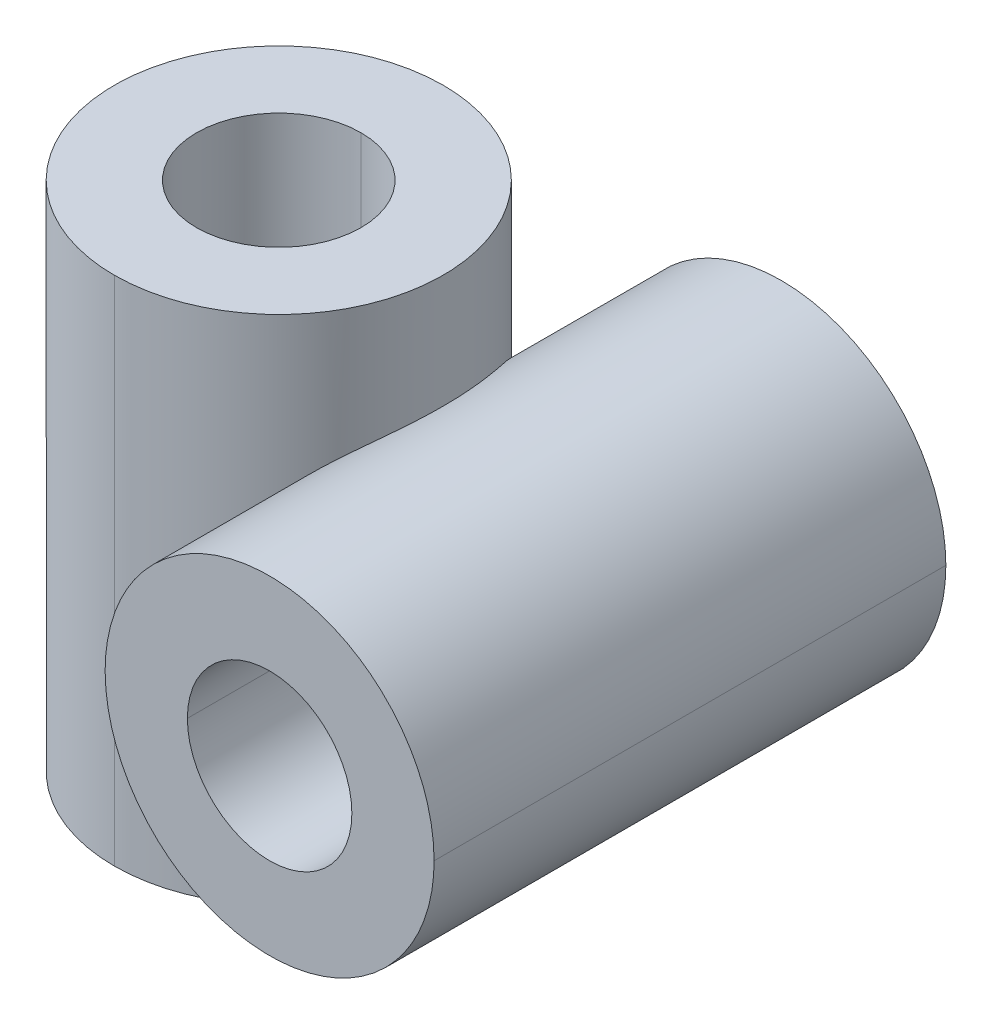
ISO-10303-21;
HEADER;
FILE_DESCRIPTION(('STEP AP214'),'2;1');
FILE_NAME('part.step','',(''),(''),'','','');
FILE_SCHEMA(('AUTOMOTIVE_DESIGN { 1 0 10303 214 1 1 1 1 }'));
ENDSEC;
DATA;
#1=APPLICATION_CONTEXT('core data for automotive mechanical design processes');
#2=APPLICATION_PROTOCOL_DEFINITION('international standard','automotive_design',2000,#1);
#3=PRODUCT_CONTEXT('',#1,'mechanical');
#4=PRODUCT('Part','Part','',(#3));
#5=PRODUCT_RELATED_PRODUCT_CATEGORY('part','',(#4));
#6=PRODUCT_DEFINITION_FORMATION('','',#4);
#7=PRODUCT_DEFINITION_CONTEXT('part definition',#1,'design');
#8=PRODUCT_DEFINITION('design','',#6,#7);
#9=PRODUCT_DEFINITION_SHAPE('','',#8);
#10=(LENGTH_UNIT() NAMED_UNIT(*) SI_UNIT(.MILLI.,.METRE.));
#11=(NAMED_UNIT(*) PLANE_ANGLE_UNIT() SI_UNIT($,.RADIAN.));
#12=(NAMED_UNIT(*) SI_UNIT($,.STERADIAN.) SOLID_ANGLE_UNIT());
#13=UNCERTAINTY_MEASURE_WITH_UNIT(LENGTH_MEASURE(1.E-05),#10,'distance_accuracy_value','');
#14=(GEOMETRIC_REPRESENTATION_CONTEXT(3) GLOBAL_UNCERTAINTY_ASSIGNED_CONTEXT((#13)) GLOBAL_UNIT_ASSIGNED_CONTEXT((#10,
#11,#12)) REPRESENTATION_CONTEXT('',''));
#15=CARTESIAN_POINT('',(0.,0.,0.));
#16=DIRECTION('',(0.,0.,1.));
#17=DIRECTION('',(1.,0.,0.));
#18=AXIS2_PLACEMENT_3D('',#15,#16,#17);
#19=CARTESIAN_POINT('',(0.,14.,0.));
#20=DIRECTION('',(0.,-1.,0.));
#21=DIRECTION('',(1.,0.,0.));
#22=AXIS2_PLACEMENT_3D('',#19,#20,#21);
#23=CYLINDRICAL_SURFACE('',#22,9.);
#24=CARTESIAN_POINT('',(0.,14.,-9.));
#25=CARTESIAN_POINT('',(-1.63949853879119,14.,-8.99933389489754));
#26=CARTESIAN_POINT('',(-3.2454537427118,14.,-8.55330248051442));
#27=CARTESIAN_POINT('',(-6.00805838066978,14.,-6.88606372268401));
#28=CARTESIAN_POINT('',(-7.12651374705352,14.,-5.72071557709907));
#29=CARTESIAN_POINT('',(-8.61875815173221,14.,-3.00245929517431));
#30=CARTESIAN_POINT('',(-9.,14.,-1.51452362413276));
#31=CARTESIAN_POINT('',(-9.,14.,1.8217198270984));
#32=CARTESIAN_POINT('',(-8.44841399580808,14.,3.5977502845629));
#33=CARTESIAN_POINT('',(-6.45761952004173,14.,6.4927835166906));
#34=CARTESIAN_POINT('',(-5.12478743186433,14.,7.5895564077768));
#35=CARTESIAN_POINT('',(-2.44333047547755,14.,8.7488479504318));
#36=CARTESIAN_POINT('',(-1.22872706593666,14.,8.9995007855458));
#37=CARTESIAN_POINT('',(0.,14.,9.));
#38=B_SPLINE_CURVE_WITH_KNOTS('',3,(#24,#25,#26,#27,#28,#29,#30,#31,#32,#33,#34,#35,#36,#37),
.UNSPECIFIED.,.F.,.F.,(4,2,2,2,2,2,4),(0.,0.172904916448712,0.340250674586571,0.499910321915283,
0.691954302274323,0.870407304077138,1.),.UNSPECIFIED.);
#39=CARTESIAN_POINT('',(0.,14.,-9.));
#40=VERTEX_POINT('',#39);
#41=CARTESIAN_POINT('',(0.,14.,9.));
#42=VERTEX_POINT('',#41);
#43=EDGE_CURVE('E10',#40,#42,#38,.T.);
#44=ORIENTED_EDGE('',*,*,#43,.F.);
#45=CARTESIAN_POINT('',(0.,14.,-9.));
#46=DIRECTION('',(0.,-1.,0.));
#47=VECTOR('',#46,1.);
#48=LINE('',#45,#47);
#49=CARTESIAN_POINT('',(0.,-14.,-9.));
#50=VERTEX_POINT('',#49);
#51=EDGE_CURVE('E25',#40,#50,#48,.T.);
#52=ORIENTED_EDGE('',*,*,#51,.T.);
#53=CARTESIAN_POINT('',(0.,-14.,0.));
#54=DIRECTION('',(0.,1.,0.));
#55=DIRECTION('',(0.,0.,-1.));
#56=AXIS2_PLACEMENT_3D('',#53,#54,#55);
#57=CIRCLE('',#56,9.);
#58=CARTESIAN_POINT('',(0.,-14.,9.));
#59=VERTEX_POINT('',#58);
#60=EDGE_CURVE('E148',#50,#59,#57,.T.);
#61=ORIENTED_EDGE('',*,*,#60,.T.);
#62=CARTESIAN_POINT('',(0.,-14.,9.));
#63=DIRECTION('',(0.,1.,0.));
#64=VECTOR('',#63,1.);
#65=LINE('',#62,#64);
#66=EDGE_CURVE('E152',#59,#42,#65,.T.);
#67=ORIENTED_EDGE('',*,*,#66,.T.);
#68=EDGE_LOOP('',(#44,#52,#61,#67));
#69=FACE_BOUND('',#68,.T.);
#70=ADVANCED_FACE('F16',(#69),#23,.T.);
#71=CARTESIAN_POINT('',(0.,14.,0.));
#72=DIRECTION('',(0.,-1.,0.));
#73=DIRECTION('',(-1.,0.,0.));
#74=AXIS2_PLACEMENT_3D('',#71,#72,#73);
#75=CYLINDRICAL_SURFACE('',#74,9.);
#76=CARTESIAN_POINT('',(0.,-14.,0.));
#77=DIRECTION('',(0.,1.,0.));
#78=DIRECTION('',(0.,0.,1.));
#79=AXIS2_PLACEMENT_3D('',#76,#77,#78);
#80=CIRCLE('',#79,9.);
#81=EDGE_CURVE('E147',#59,#50,#80,.T.);
#82=ORIENTED_EDGE('',*,*,#81,.T.);
#83=ORIENTED_EDGE('',*,*,#51,.F.);
#84=CARTESIAN_POINT('',(0.,14.,9.));
#85=CARTESIAN_POINT('',(1.6394985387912,14.,8.9993338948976));
#86=CARTESIAN_POINT('',(3.2454537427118,14.,8.5533024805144));
#87=CARTESIAN_POINT('',(6.0080583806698,14.,6.886063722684));
#88=CARTESIAN_POINT('',(7.1265137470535,14.,5.7207155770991));
#89=CARTESIAN_POINT('',(8.6187581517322,14.,3.0024592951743));
#90=CARTESIAN_POINT('',(9.,14.,1.5145236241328));
#91=CARTESIAN_POINT('',(9.,14.,-1.82171982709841));
#92=CARTESIAN_POINT('',(8.4484139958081,14.,-3.59775028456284));
#93=CARTESIAN_POINT('',(6.4576195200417,14.,-6.49278351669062));
#94=CARTESIAN_POINT('',(5.1247874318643,14.,-7.58955640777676));
#95=CARTESIAN_POINT('',(2.4433304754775,14.,-8.74884795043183));
#96=CARTESIAN_POINT('',(1.2287270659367,14.,-8.99950078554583));
#97=CARTESIAN_POINT('',(0.,14.,-9.));
#98=B_SPLINE_CURVE_WITH_KNOTS('',3,(#84,#85,#86,#87,#88,#89,#90,#91,#92,#93,#94,#95,#96,#97),
.UNSPECIFIED.,.F.,.F.,(4,2,2,2,2,2,4),(0.,0.17290491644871,0.340250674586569,0.499910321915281,
0.691954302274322,0.870407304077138,1.),.UNSPECIFIED.);
#99=EDGE_CURVE('E153',#42,#40,#98,.T.);
#100=ORIENTED_EDGE('',*,*,#99,.F.);
#101=ORIENTED_EDGE('',*,*,#66,.F.);
#102=EDGE_LOOP('',(#82,#83,#100,#101));
#103=FACE_BOUND('',#102,.T.);
#104=CARTESIAN_POINT('',(4.49999999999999,0.,-7.7942287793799));
#105=CARTESIAN_POINT('',(4.49999996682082,0.038225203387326,-7.7942287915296));
#106=CARTESIAN_POINT('',(4.50024352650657,0.0764504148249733,-7.79408902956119));
#107=CARTESIAN_POINT('',(4.50121757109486,0.152890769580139,-7.79352882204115));
#108=CARTESIAN_POINT('',(4.50194803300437,0.191105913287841,-7.79310838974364));
#109=CARTESIAN_POINT('',(4.50389558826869,0.267518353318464,-7.79198572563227));
#110=CARTESIAN_POINT('',(4.50511266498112,0.305715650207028,-7.79128350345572));
#111=CARTESIAN_POINT('',(4.50803294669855,0.382084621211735,-7.78959614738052));
#112=CARTESIAN_POINT('',(4.5097361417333,0.420256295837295,-7.78861101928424));
#113=CARTESIAN_POINT('',(4.51362801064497,0.49656626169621,-7.78635673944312));
#114=CARTESIAN_POINT('',(4.515816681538,0.534704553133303,-7.78508758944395));
#115=CARTESIAN_POINT('',(4.52067868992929,0.610940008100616,-7.78226415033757));
#116=CARTESIAN_POINT('',(4.52335203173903,0.649037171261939,-7.78070985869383));
#117=CARTESIAN_POINT('',(4.52918241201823,0.725182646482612,-7.77731503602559));
#118=CARTESIAN_POINT('',(4.53233946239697,0.763230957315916,-7.77547449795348));
#119=CARTESIAN_POINT('',(4.53913613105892,0.839271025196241,-7.77150602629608));
#120=CARTESIAN_POINT('',(4.5427757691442,0.877262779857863,-7.76937808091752));
#121=CARTESIAN_POINT('',(4.55053625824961,0.953181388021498,-7.7648338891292));
#122=CARTESIAN_POINT('',(4.55465712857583,0.991108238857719,-7.76241763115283));
#123=CARTESIAN_POINT('',(4.56337801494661,1.06688419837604,-7.75729546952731));
#124=CARTESIAN_POINT('',(4.56797799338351,1.1047333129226,-7.75458958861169));
#125=CARTESIAN_POINT('',(4.57765510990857,1.18034496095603,-7.74888456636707));
#126=CARTESIAN_POINT('',(4.58273220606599,1.21810750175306,-7.7458854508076));
#127=CARTESIAN_POINT('',(4.59336150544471,1.29353829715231,-7.73959064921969));
#128=CARTESIAN_POINT('',(4.5989136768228,1.33120655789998,-7.7362949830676));
#129=CARTESIAN_POINT('',(4.6104909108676,1.40644113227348,-7.72940367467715));
#130=CARTESIAN_POINT('',(4.61651595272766,1.44400745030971,-7.72580804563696));
#131=CARTESIAN_POINT('',(4.62903655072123,1.51903053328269,-7.71831343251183));
#132=CARTESIAN_POINT('',(4.63553209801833,1.55648730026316,-7.71441445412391));
#133=CARTESIAN_POINT('',(4.64899116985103,1.63128373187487,-7.70630975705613));
#134=CARTESIAN_POINT('',(4.65595469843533,1.66862339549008,-7.70210403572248));
#135=CARTESIAN_POINT('',(4.67034703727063,1.74317813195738,-7.69338247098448));
#136=CARTESIAN_POINT('',(4.67777586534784,1.78039319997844,-7.68886661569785));
#137=CARTESIAN_POINT('',(4.69309595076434,1.85469132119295,-7.6795213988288));
#138=CARTESIAN_POINT('',(4.70098724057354,1.89177436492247,-7.67469201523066));
#139=CARTESIAN_POINT('',(4.71722924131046,1.96580108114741,-7.66471636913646));
#140=CARTESIAN_POINT('',(4.72558000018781,2.00274473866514,-7.65957007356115));
#141=CARTESIAN_POINT('',(4.74273691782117,2.07648169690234,-7.64895772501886));
#142=CARTESIAN_POINT('',(4.75154309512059,2.11327499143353,-7.64349165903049));
#143=CARTESIAN_POINT('',(4.76960537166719,2.18669583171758,-7.63223498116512));
#144=CARTESIAN_POINT('',(4.77886141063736,2.22332339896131,-7.6264444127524));
#145=CARTESIAN_POINT('',(4.79781936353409,2.29640526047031,-7.61453367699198));
#146=CARTESIAN_POINT('',(4.80752123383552,2.33285957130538,-7.60841354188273));
#147=CARTESIAN_POINT('',(4.82736669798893,2.40558773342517,-7.59583843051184));
#148=CARTESIAN_POINT('',(4.83751026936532,2.44186159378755,-7.58938347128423));
#149=CARTESIAN_POINT('',(4.85823483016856,2.5142217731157,-7.57613350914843));
#150=CARTESIAN_POINT('',(4.86881581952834,2.55030809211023,-7.56933850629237));
#151=CARTESIAN_POINT('',(4.89041075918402,2.62228621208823,-7.55540326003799));
#152=CARTESIAN_POINT('',(4.90142473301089,2.6581780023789,-7.54826299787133));
#153=CARTESIAN_POINT('',(4.92388103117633,2.72976018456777,-7.53363198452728));
#154=CARTESIAN_POINT('',(4.93532340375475,2.76545055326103,-7.52614119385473));
#155=CARTESIAN_POINT('',(4.95863090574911,2.83662056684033,-7.51080464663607));
#156=CARTESIAN_POINT('',(4.97049607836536,2.87210018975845,-7.50295885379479));
#157=CARTESIAN_POINT('',(4.99463928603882,2.94282774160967,-7.48690967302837));
#158=CARTESIAN_POINT('',(5.00691722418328,2.97807572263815,-7.4787063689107));
#159=CARTESIAN_POINT('',(5.03187941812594,3.04833122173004,-7.4619360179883));
#160=CARTESIAN_POINT('',(5.04456358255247,3.08333879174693,-7.45336905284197));
#161=CARTESIAN_POINT('',(5.07033224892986,3.15310708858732,-7.43586503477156));
#162=CARTESIAN_POINT('',(5.08341669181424,3.18786785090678,-7.42692803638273));
#163=CARTESIAN_POINT('',(5.10997979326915,3.2571362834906,-7.40867754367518));
#164=CARTESIAN_POINT('',(5.12345842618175,3.29164397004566,-7.39936407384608));
#165=CARTESIAN_POINT('',(5.15080365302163,3.36040015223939,-7.38035424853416));
#166=CARTESIAN_POINT('',(5.16467025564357,3.3946486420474,-7.37065788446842));
#167=CARTESIAN_POINT('',(5.19278503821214,3.46288048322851,-7.35087588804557));
#168=CARTESIAN_POINT('',(5.20703326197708,3.49686380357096,-7.34079021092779));
#169=CARTESIAN_POINT('',(5.23590477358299,3.56455950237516,-7.32022317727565));
#170=CARTESIAN_POINT('',(5.25052814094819,3.59827182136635,-7.30974173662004));
#171=CARTESIAN_POINT('',(5.28014256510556,3.6654181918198,-7.28837743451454));
#172=CARTESIAN_POINT('',(5.29513371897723,3.69885216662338,-7.27749446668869));
#173=CARTESIAN_POINT('',(5.32546602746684,3.76541252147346,-7.25532832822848));
#174=CARTESIAN_POINT('',(5.3408070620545,3.79853900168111,-7.24404529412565));
#175=CARTESIAN_POINT('',(5.37182762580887,3.86447158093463,-7.22107432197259));
#176=CARTESIAN_POINT('',(5.38750699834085,3.89727781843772,-7.20938656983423));
#177=CARTESIAN_POINT('',(5.41919598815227,3.96256517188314,-7.18559931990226));
#178=CARTESIAN_POINT('',(5.43520549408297,3.99504639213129,-7.17349996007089));
#179=CARTESIAN_POINT('',(5.46754640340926,4.05967914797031,-7.14888259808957));
#180=CARTESIAN_POINT('',(5.48387774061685,4.09183074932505,-7.13636468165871));
#181=CARTESIAN_POINT('',(5.51685388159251,4.15579990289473,-7.11090333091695));
#182=CARTESIAN_POINT('',(5.53349866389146,4.18761747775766,-7.09795992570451));
#183=CARTESIAN_POINT('',(5.56709318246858,4.25091440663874,-7.07164071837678));
#184=CARTESIAN_POINT('',(5.58404294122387,4.28239373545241,-7.05826488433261));
#185=CARTESIAN_POINT('',(5.61823882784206,4.34501020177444,-7.03107395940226));
#186=CARTESIAN_POINT('',(5.63548502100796,4.37614726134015,-7.01725877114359));
#187=CARTESIAN_POINT('',(5.6702651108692,4.43807539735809,-6.98918223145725));
#188=CARTESIAN_POINT('',(5.68779911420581,4.46886633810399,-6.974920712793));
#189=CARTESIAN_POINT('',(5.72314610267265,4.53009865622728,-6.94594482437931));
#190=CARTESIAN_POINT('',(5.74095923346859,4.56053983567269,-6.93123021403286));
#191=CARTESIAN_POINT('',(5.77684230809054,4.62104667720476,-6.90135177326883));
#192=CARTESIAN_POINT('',(5.79491224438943,4.65111235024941,-6.88618795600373));
#193=CARTESIAN_POINT('',(5.83128799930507,4.71084690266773,-6.85541288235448));
#194=CARTESIAN_POINT('',(5.84959370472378,4.74051595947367,-6.83980183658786));
#195=CARTESIAN_POINT('',(5.88643071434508,4.79945518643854,-6.80812610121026));
#196=CARTESIAN_POINT('',(5.90496195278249,4.82872546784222,-6.79206154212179));
#197=CARTESIAN_POINT('',(5.94223970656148,4.88686522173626,-6.75947244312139));
#198=CARTESIAN_POINT('',(5.96098620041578,4.91573473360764,-6.74294794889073));
#199=CARTESIAN_POINT('',(5.99868414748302,4.97307125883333,-6.70943268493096));
#200=CARTESIAN_POINT('',(6.01763561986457,5.0015382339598,-6.69244187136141));
#201=CARTESIAN_POINT('',(6.05573320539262,5.05806820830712,-6.65798766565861));
#202=CARTESIAN_POINT('',(6.0748793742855,5.08613108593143,-6.6405241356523));
#203=CARTESIAN_POINT('',(6.11335598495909,5.14185152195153,-6.60511826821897));
#204=CARTESIAN_POINT('',(6.13268651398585,5.16950887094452,-6.58717569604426));
#205=CARTESIAN_POINT('',(6.17150448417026,5.22439308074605,-6.55082139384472));
#206=CARTESIAN_POINT('',(6.19099189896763,5.25162001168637,-6.53240974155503));
#207=CARTESIAN_POINT('',(6.23009890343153,5.3056242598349,-6.4951242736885));
#208=CARTESIAN_POINT('',(6.24971839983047,5.33240185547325,-6.47625076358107));
#209=CARTESIAN_POINT('',(6.28907798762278,5.38550792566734,-6.43803680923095));
#210=CARTESIAN_POINT('',(6.30881802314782,5.41183658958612,-6.41869657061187));
#211=CARTESIAN_POINT('',(6.34840718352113,5.46404550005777,-6.37954438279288));
#212=CARTESIAN_POINT('',(6.36825628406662,5.48992584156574,-6.35973253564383));
#213=CARTESIAN_POINT('',(6.40805214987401,5.54123902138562,-6.31963235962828));
#214=CARTESIAN_POINT('',(6.42799891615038,5.56667185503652,-6.29934402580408));
#215=CARTESIAN_POINT('',(6.46797877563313,5.61709114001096,-6.25828611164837));
#216=CARTESIAN_POINT('',(6.48801188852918,5.64207748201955,-6.23751641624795));
#217=CARTESIAN_POINT('',(6.52815318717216,5.69160509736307,-6.1954910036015));
#218=CARTESIAN_POINT('',(6.54826140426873,5.7161461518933,-6.1742350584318));
#219=CARTESIAN_POINT('',(6.58854122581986,5.76478406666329,-6.13123300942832));
#220=CARTESIAN_POINT('',(6.60871286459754,5.78888060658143,-6.10948657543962));
#221=CARTESIAN_POINT('',(6.64908304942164,5.83660118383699,-6.06552627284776));
#222=CARTESIAN_POINT('',(6.66928158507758,5.86022536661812,-6.04331255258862));
#223=CARTESIAN_POINT('',(6.70967971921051,5.90698776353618,-5.99842962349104));
#224=CARTESIAN_POINT('',(6.72987930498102,5.93012633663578,-5.97576077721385));
#225=CARTESIAN_POINT('',(6.77026746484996,5.97592098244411,-5.92996547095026));
#226=CARTESIAN_POINT('',(6.79045603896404,5.99857731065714,-5.90683926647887));
#227=CARTESIAN_POINT('',(6.83081025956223,6.04341108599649,-5.86012709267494));
#228=CARTESIAN_POINT('',(6.85097591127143,6.06558868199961,-5.8365412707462));
#229=CARTESIAN_POINT('',(6.89127254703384,6.10946877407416,-5.78890771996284));
#230=CARTESIAN_POINT('',(6.91140353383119,6.13117130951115,-5.764860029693));
#231=CARTESIAN_POINT('',(6.95161927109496,6.17410520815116,-5.71630059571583));
#232=CARTESIAN_POINT('',(6.97170401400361,6.19533649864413,-5.69178878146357));
#233=CARTESIAN_POINT('',(7.01181587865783,6.23733198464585,-5.64229896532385));
#234=CARTESIAN_POINT('',(7.03184297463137,6.2580959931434,-5.61732078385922));
#235=CARTESIAN_POINT('',(7.07182830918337,6.29916109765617,-5.56689605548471));
#236=CARTESIAN_POINT('',(7.09178649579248,6.31946189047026,-5.5414492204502));
#237=CARTESIAN_POINT('',(7.13162211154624,6.35960402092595,-5.49008639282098));
#238=CARTESIAN_POINT('',(7.1514994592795,6.37944496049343,-5.46417002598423));
#239=CARTESIAN_POINT('',(7.19113800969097,6.41864762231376,-5.41189739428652));
#240=CARTESIAN_POINT('',(7.2108992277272,6.43800940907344,-5.38554118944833));
#241=CARTESIAN_POINT('',(7.25028349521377,6.47624865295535,-5.33240261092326));
#242=CARTESIAN_POINT('',(7.26990660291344,6.49512632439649,-5.30562043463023));
#243=CARTESIAN_POINT('',(7.3090034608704,6.53240317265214,-5.25163062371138));
#244=CARTESIAN_POINT('',(7.32847724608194,6.55080246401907,-5.22442309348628));
#245=CARTESIAN_POINT('',(7.36726446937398,6.58712842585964,-5.16958323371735));
#246=CARTESIAN_POINT('',(7.38657791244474,6.60505511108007,-5.14195091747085));
#247=CARTESIAN_POINT('',(7.42503370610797,6.64044180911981,-5.08626216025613));
#248=CARTESIAN_POINT('',(7.44417602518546,6.65790173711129,-5.05820564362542));
#249=CARTESIAN_POINT('',(7.48227903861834,6.6923609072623,-5.00166913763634));
#250=CARTESIAN_POINT('',(7.50123965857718,6.70935996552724,-4.97318898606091));
#251=CARTESIAN_POINT('',(7.53896588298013,6.74290068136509,-4.91581070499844));
#252=CARTESIAN_POINT('',(7.55773139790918,6.75944213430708,-4.88691239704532));
#253=CARTESIAN_POINT('',(7.59503774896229,6.79205671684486,-4.82872876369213));
#254=CARTESIAN_POINT('',(7.61357866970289,6.808130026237,-4.79944359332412));
#255=CARTESIAN_POINT('',(7.65042231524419,6.83981220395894,-4.74049420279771));
#256=CARTESIAN_POINT('',(7.66872513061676,6.855421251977,-4.71083013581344));
#257=CARTESIAN_POINT('',(7.70508267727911,6.88618182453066,-4.65112603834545));
#258=CARTESIAN_POINT('',(7.72313746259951,6.90133344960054,-4.62108609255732));
#259=CARTESIAN_POINT('',(7.75898930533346,6.93118606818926,-4.56063330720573));
#260=CARTESIAN_POINT('',(7.77678637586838,6.94588708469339,-4.53022048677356));
#261=CARTESIAN_POINT('',(7.81211340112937,6.97484535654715,-4.46902502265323));
#262=CARTESIAN_POINT('',(7.82964332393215,6.98910255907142,-4.43824233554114));
#263=CARTESIAN_POINT('',(7.86442691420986,7.0171800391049,-4.37631020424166));
#264=CARTESIAN_POINT('',(7.88168050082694,7.03100018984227,-4.34516065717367));
#265=CARTESIAN_POINT('',(7.91590252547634,7.0582103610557,-4.28249787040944));
#266=CARTESIAN_POINT('',(7.93287083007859,7.07160018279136,-4.250984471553));
#267=CARTESIAN_POINT('',(7.9665059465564,7.09795041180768,-4.18761153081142));
#268=CARTESIAN_POINT('',(7.98317270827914,7.11091074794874,-4.15575193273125));
#269=CARTESIAN_POINT('',(8.01618428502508,7.13639964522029,-4.09171306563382));
#270=CARTESIAN_POINT('',(8.03252922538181,7.14892837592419,-4.05953392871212));
#271=CARTESIAN_POINT('',(8.06488884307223,7.17356118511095,-3.99486142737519));
#272=CARTESIAN_POINT('',(8.0809036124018,7.18566538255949,-3.96236815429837));
#273=CARTESIAN_POINT('',(8.11259495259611,7.20945624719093,-3.89707257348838));
#274=CARTESIAN_POINT('',(8.12827157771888,7.22114298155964,-3.86427031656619));
#275=CARTESIAN_POINT('',(8.15927894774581,7.24410593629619,-3.79836196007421));
#276=CARTESIAN_POINT('',(8.17460970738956,7.25538217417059,-3.7652558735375));
#277=CARTESIAN_POINT('',(8.20491790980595,7.2775310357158,-3.69874504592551));
#278=CARTESIAN_POINT('',(8.21989532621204,7.2884036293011,-3.66534028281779));
#279=CARTESIAN_POINT('',(8.24948965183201,7.30975198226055,-3.59823729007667));
#280=CARTESIAN_POINT('',(8.26410649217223,7.32022766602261,-3.56453900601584));
#281=CARTESIAN_POINT('',(8.29297269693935,7.34078883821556,-3.49685414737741));
#282=CARTESIAN_POINT('',(8.30722194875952,7.35087420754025,-3.46286748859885));
#283=CARTESIAN_POINT('',(8.33534580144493,7.37066094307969,-3.39461229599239));
#284=CARTESIAN_POINT('',(8.34922025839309,7.38036216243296,-3.36034366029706));
#285=CARTESIAN_POINT('',(8.37657963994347,7.39938114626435,-3.29155025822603));
#286=CARTESIAN_POINT('',(8.39006460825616,7.40869895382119,-3.2570255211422));
#287=CARTESIAN_POINT('',(8.416635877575,7.42695556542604,-3.18773364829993));
#288=CARTESIAN_POINT('',(8.42972227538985,7.43589446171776,-3.15296657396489));
#289=CARTESIAN_POINT('',(8.45549057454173,7.45339970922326,-3.08319672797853));
#290=CARTESIAN_POINT('',(8.46817254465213,7.461966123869,-3.0481939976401));
#291=CARTESIAN_POINT('',(8.49312637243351,7.47873267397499,-2.97795952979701));
#292=CARTESIAN_POINT('',(8.50539827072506,7.48693284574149,-2.94272781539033));
#293=CARTESIAN_POINT('',(8.52952656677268,7.50297299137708,-2.87204207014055));
#294=CARTESIAN_POINT('',(8.54138297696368,7.51081297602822,-2.83658804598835));
#295=CARTESIAN_POINT('',(8.56467512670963,7.5261386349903,-2.76546436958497));
#296=CARTESIAN_POINT('',(8.57611085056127,7.53362429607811,-2.72979470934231));
#297=CARTESIAN_POINT('',(8.59855667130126,7.54824699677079,-2.6582464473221));
#298=CARTESIAN_POINT('',(8.60956672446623,7.55538400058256,-2.62236782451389));
#299=CARTESIAN_POINT('',(8.63115645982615,7.56931487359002,-2.55040832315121));
#300=CARTESIAN_POINT('',(8.64173607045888,7.57610868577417,-2.51432741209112));
#301=CARTESIAN_POINT('',(8.66246037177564,7.58935844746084,-2.44197001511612));
#302=CARTESIAN_POINT('',(8.67260496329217,7.59581431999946,-2.4056934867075));
#303=CARTESIAN_POINT('',(8.69245415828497,7.60839280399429,-2.33295432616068));
#304=CARTESIAN_POINT('',(8.70215866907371,7.61451534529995,-2.296491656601));
#305=CARTESIAN_POINT('',(8.72112007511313,7.62642983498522,-2.22339933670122));
#306=CARTESIAN_POINT('',(8.73037700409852,7.63222180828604,-2.18676969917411));
#307=CARTESIAN_POINT('',(8.74843914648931,7.64347975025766,-2.11335227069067));
#308=CARTESIAN_POINT('',(8.75724439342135,7.64894574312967,-2.07656449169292));
#309=CARTESIAN_POINT('',(8.77439965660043,7.65955632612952,-2.00283817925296));
#310=CARTESIAN_POINT('',(8.78274968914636,7.66470092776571,-1.96589965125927));
#311=CARTESIAN_POINT('',(8.79899120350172,7.67467309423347,-1.89187924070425));
#312=CARTESIAN_POINT('',(8.80688268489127,7.67950065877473,-1.8547973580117));
#313=CARTESIAN_POINT('',(8.8222039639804,7.68884287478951,-1.78049763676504));
#314=CARTESIAN_POINT('',(8.82963374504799,7.69335751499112,-1.74327979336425));
#315=CARTESIAN_POINT('',(8.84402867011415,7.70207775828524,-1.66871554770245));
#316=CARTESIAN_POINT('',(8.85099378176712,7.70628333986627,-1.63136913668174));
#317=CARTESIAN_POINT('',(8.86445655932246,7.71438907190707,-1.55655544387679));
#318=CARTESIAN_POINT('',(8.87095418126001,7.71828919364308,-1.51908815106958));
#319=CARTESIAN_POINT('',(8.88347840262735,7.72578679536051,-1.44404569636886));
#320=CARTESIAN_POINT('',(8.88950501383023,7.72938428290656,-1.40647053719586));
#321=CARTESIAN_POINT('',(8.90108456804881,7.73627961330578,-1.33122211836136));
#322=CARTESIAN_POINT('',(8.90663753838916,7.73957747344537,-1.29354886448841));
#323=CARTESIAN_POINT('',(8.91726775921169,7.7458765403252,-1.21811193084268));
#324=CARTESIAN_POINT('',(8.92234502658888,7.7488777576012,-1.18034825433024));
#325=CARTESIAN_POINT('',(8.93202195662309,7.75458626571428,-1.10473814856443));
#326=CARTESIAN_POINT('',(8.93662162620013,7.7572935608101,-1.06689172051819));
#327=CARTESIAN_POINT('',(8.94534164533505,7.76241668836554,-0.991123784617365));
#328=CARTESIAN_POINT('',(8.94946199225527,7.76483251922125,-0.95320227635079));
#329=CARTESIAN_POINT('',(8.957221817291,7.76937491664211,-0.877291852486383));
#330=CARTESIAN_POINT('',(8.96086128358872,7.77150147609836,-0.839302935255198));
#331=CARTESIAN_POINT('',(8.9676579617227,7.77546726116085,-0.763265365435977));
#332=CARTESIAN_POINT('',(8.9708151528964,7.77730647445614,-0.725216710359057));
#333=CARTESIAN_POINT('',(8.97664606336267,7.78069923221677,-0.649067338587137));
#334=CARTESIAN_POINT('',(8.97931975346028,7.7822527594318,-0.610966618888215));
#335=CARTESIAN_POINT('',(8.98418240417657,7.78507542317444,-0.534723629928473));
#336=CARTESIAN_POINT('',(8.98637136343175,7.7863445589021,-0.496581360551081));
#337=CARTESIAN_POINT('',(8.99026359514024,7.78859952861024,-0.420265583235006));
#338=CARTESIAN_POINT('',(8.9919668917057,7.7895853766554,-0.382092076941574));
#339=CARTESIAN_POINT('',(8.99488724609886,7.7912747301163,-0.305721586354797));
#340=CARTESIAN_POINT('',(8.99610432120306,7.79197824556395,-0.267524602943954));
#341=CARTESIAN_POINT('',(8.99805183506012,7.79310361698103,-0.191114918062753));
#342=CARTESIAN_POINT('',(8.99878228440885,7.79352547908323,-0.152902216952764));
#343=CARTESIAN_POINT('',(8.99975630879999,7.79408795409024,-0.0764688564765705));
#344=CARTESIAN_POINT('',(8.99999988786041,7.79422856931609,-0.0382481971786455));
#345=CARTESIAN_POINT('',(9.00000009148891,7.79422868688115,0.0381933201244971));
#346=CARTESIAN_POINT('',(8.99975671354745,7.79408818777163,0.0764141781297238));
#347=CARTESIAN_POINT('',(8.99878308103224,7.79352593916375,0.15284833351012));
#348=CARTESIAN_POINT('',(8.99805281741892,7.79310418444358,0.19106163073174));
#349=CARTESIAN_POINT('',(8.99610564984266,7.79197901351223,0.267472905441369));
#350=CARTESIAN_POINT('',(8.99488873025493,7.79127558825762,0.305670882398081));
#351=CARTESIAN_POINT('',(8.99196864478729,7.78958639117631,0.382043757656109));
#352=CARTESIAN_POINT('',(8.99026545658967,7.78860060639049,0.420218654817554));
#353=CARTESIAN_POINT('',(8.98637345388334,7.78634577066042,0.496536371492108));
#354=CARTESIAN_POINT('',(8.98418462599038,7.78507671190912,0.534679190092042));
#355=CARTESIAN_POINT('',(8.97932232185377,7.78225425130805,0.610921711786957));
#356=CARTESIAN_POINT('',(8.97664886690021,7.78070086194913,0.649021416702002));
#357=CARTESIAN_POINT('',(8.97081835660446,7.77730834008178,0.725169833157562));
#358=CARTESIAN_POINT('',(8.96766131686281,7.77546921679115,0.76321854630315));
#359=CARTESIAN_POINT('',(8.9608648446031,7.77150355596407,0.839257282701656));
#360=CARTESIAN_POINT('',(8.95722541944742,7.7693770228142,0.87724730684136));
#361=CARTESIAN_POINT('',(8.94946554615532,7.76483460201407,0.953160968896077));
#362=CARTESIAN_POINT('',(8.94534509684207,7.76241871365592,0.991084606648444));
#363=CARTESIAN_POINT('',(8.93662471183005,7.75729537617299,1.06685780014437));
#364=CARTESIAN_POINT('',(8.9320247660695,7.75458792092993,1.10470735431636));
#365=CARTESIAN_POINT('',(8.9223470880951,7.74887897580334,1.18032468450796));
#366=CARTESIAN_POINT('',(8.917269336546,7.74587747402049,1.21809245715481));
#367=CARTESIAN_POINT('',(8.90663818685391,7.73957785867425,1.29353671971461));
#368=CARTESIAN_POINT('',(8.90108478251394,7.73627974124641,1.3312132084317));
#369=CARTESIAN_POINT('',(8.88950517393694,7.72938437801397,1.40646251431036));
#370=CARTESIAN_POINT('',(8.88347901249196,7.72578715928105,1.44403534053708));
#371=CARTESIAN_POINT('',(8.87095630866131,7.71829046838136,1.51906958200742));
#372=CARTESIAN_POINT('',(8.86445979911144,7.7143910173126,1.55653100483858));
#373=CARTESIAN_POINT('',(8.85099897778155,7.70628647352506,1.63133496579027));
#374=CARTESIAN_POINT('',(8.84403468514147,7.70208139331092,1.66867750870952));
#375=CARTESIAN_POINT('',(8.82964105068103,7.69336194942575,1.74323623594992));
#376=CARTESIAN_POINT('',(8.82221171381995,7.68884758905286,1.78045242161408));
#377=CARTESIAN_POINT('',(8.80689092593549,7.67950569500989,1.85475096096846));
#378=CARTESIAN_POINT('',(8.79899946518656,7.67467815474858,1.89183331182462));
#379=CARTESIAN_POINT('',(8.78275755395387,7.66470576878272,1.96585671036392));
#380=CARTESIAN_POINT('',(8.77440707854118,7.6595609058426,2.00279775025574));
#381=CARTESIAN_POINT('',(8.75725043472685,7.64894949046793,2.07653105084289));
#382=CARTESIAN_POINT('',(8.74844422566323,7.64348290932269,2.11332329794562));
#383=CARTESIAN_POINT('',(8.73038086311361,7.63222422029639,2.18674669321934));
#384=CARTESIAN_POINT('',(8.72112371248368,7.62643211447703,2.22337784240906));
#385=CARTESIAN_POINT('',(8.70216454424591,7.61451904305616,2.29646305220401));
#386=CARTESIAN_POINT('',(8.69246261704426,7.60839814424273,2.33291714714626));
#387=CARTESIAN_POINT('',(8.67261804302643,7.59582262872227,2.40564117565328));
#388=CARTESIAN_POINT('',(8.6624754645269,7.58936806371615,2.44191113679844));
#389=CARTESIAN_POINT('',(8.64175393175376,7.57612013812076,2.51426003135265));
#390=CARTESIAN_POINT('',(8.63117502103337,7.56932681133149,2.5503389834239));
#391=CARTESIAN_POINT('',(8.60958535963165,7.55539606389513,2.62229899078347));
#392=CARTESIAN_POINT('',(8.59857462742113,7.54825865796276,2.65818005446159));
#393=CARTESIAN_POINT('',(8.57612607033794,7.53363424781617,2.72973741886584));
#394=CARTESIAN_POINT('',(8.56468823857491,7.52614723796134,2.76541371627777));
#395=CARTESIAN_POINT('',(8.54139043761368,7.51081790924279,2.83655468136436));
#396=CARTESIAN_POINT('',(8.52953043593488,7.50297556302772,2.87201933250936));
#397=CARTESIAN_POINT('',(8.50539347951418,7.48692966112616,2.94273014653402));
#398=CARTESIAN_POINT('',(8.49311646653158,7.47872605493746,2.97797627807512));
#399=CARTESIAN_POINT('',(8.46815084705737,7.46195150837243,3.04824317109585));
#400=CARTESIAN_POINT('',(8.45546215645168,7.45338049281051,3.08326388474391));
#401=CARTESIAN_POINT('',(8.42968340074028,7.4358679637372,3.15306107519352));
#402=CARTESIAN_POINT('',(8.41659336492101,7.42692647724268,3.18783756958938));
#403=CARTESIAN_POINT('',(8.39002377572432,7.40867077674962,3.25712476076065));
#404=CARTESIAN_POINT('',(8.37654439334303,7.39935672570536,3.29163556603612));
#405=CARTESIAN_POINT('',(8.34920240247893,7.3803496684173,3.36038585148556));
#406=CARTESIAN_POINT('',(8.33533992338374,7.37065678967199,3.3946254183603));
#407=CARTESIAN_POINT('',(8.30723830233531,7.35088573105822,3.46282780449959));
#408=CARTESIAN_POINT('',(8.29299924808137,7.34080764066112,3.49679068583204));
#409=CARTESIAN_POINT('',(8.26415125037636,7.32025965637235,3.56443427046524));
#410=CARTESIAN_POINT('',(8.24954235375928,7.30978981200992,3.59811500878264));
#411=CARTESIAN_POINT('',(8.21996168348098,7.28845168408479,3.66518888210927));
#412=CARTESIAN_POINT('',(8.20498991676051,7.27758340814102,3.69858202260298));
#413=CARTESIAN_POINT('',(8.17469075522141,7.25544165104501,3.7650752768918));
#414=CARTESIAN_POINT('',(8.15936332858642,7.24416813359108,3.79817536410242));
#415=CARTESIAN_POINT('',(8.12836033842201,7.22120900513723,3.86407709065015));
#416=CARTESIAN_POINT('',(8.11268470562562,7.20952331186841,3.89687866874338));
#417=CARTESIAN_POINT('',(8.08099304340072,7.18573283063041,3.96217796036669));
#418=CARTESIAN_POINT('',(8.06497690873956,7.17362791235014,3.99467557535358));
#419=CARTESIAN_POINT('',(8.03261222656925,7.14899186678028,4.05936151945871));
#420=CARTESIAN_POINT('',(8.01626353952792,7.13646055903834,4.09154971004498));
#421=CARTESIAN_POINT('',(7.9832493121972,7.11097017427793,4.15559727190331));
#422=CARTESIAN_POINT('',(7.96658373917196,7.09801105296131,4.18745660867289));
#423=CARTESIAN_POINT('',(7.9329559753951,7.07166718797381,4.25081926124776));
#424=CARTESIAN_POINT('',(7.91599392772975,7.0582826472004,4.28232273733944));
#425=CARTESIAN_POINT('',(7.88178213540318,7.03108138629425,4.34497014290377));
#426=CARTESIAN_POINT('',(7.86453248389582,7.01726480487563,4.37611418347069));
#427=CARTESIAN_POINT('',(7.82975449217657,6.98919274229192,4.43803953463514));
#428=CARTESIAN_POINT('',(7.81222619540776,6.97493732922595,4.4688209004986));
#429=CARTESIAN_POINT('',(7.77690016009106,6.9459808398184,4.53001771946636));
#430=CARTESIAN_POINT('',(7.7591024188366,6.9312797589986,4.56043316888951));
#431=CARTESIAN_POINT('',(7.72324698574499,6.9014251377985,4.62089497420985));
#432=CARTESIAN_POINT('',(7.70518924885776,6.88627151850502,4.65094126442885));
#433=CARTESIAN_POINT('',(7.66882356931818,6.85550500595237,4.71066158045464));
#434=CARTESIAN_POINT('',(7.65051554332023,6.83989195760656,4.74033547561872));
#435=CARTESIAN_POINT('',(7.61366035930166,6.80820068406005,4.79930604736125));
#436=CARTESIAN_POINT('',(7.59511309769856,6.79212225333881,4.82860254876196));
#437=CARTESIAN_POINT('',(7.5578096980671,6.7595109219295,4.88678436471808));
#438=CARTESIAN_POINT('',(7.53905365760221,6.74297822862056,4.9156698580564));
#439=CARTESIAN_POINT('',(7.50135019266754,6.70945872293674,4.97301710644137));
#440=CARTESIAN_POINT('',(7.48240289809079,6.69247220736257,5.00147912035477));
#441=CARTESIAN_POINT('',(7.44432729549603,6.65803925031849,5.05797897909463));
#442=CARTESIAN_POINT('',(7.42519906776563,6.64059300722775,5.08601699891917));
#443=CARTESIAN_POINT('',(7.38677217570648,6.60523482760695,5.141668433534));
#444=CARTESIAN_POINT('',(7.36747354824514,6.58732299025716,5.16928193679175));
#445=CARTESIAN_POINT('',(7.32871665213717,6.55102791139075,5.22408390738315));
#446=CARTESIAN_POINT('',(7.30925838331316,6.5326446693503,5.25127237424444));
#447=CARTESIAN_POINT('',(7.27019321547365,6.49540113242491,5.30522384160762));
#448=CARTESIAN_POINT('',(7.25058628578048,6.47654073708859,5.33198675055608));
#449=CARTESIAN_POINT('',(7.21123502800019,6.43833732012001,5.3850866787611));
#450=CARTESIAN_POINT('',(7.19149064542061,6.41899409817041,5.41142351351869));
#451=CARTESIAN_POINT('',(7.15187592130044,6.37981952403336,5.46367085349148));
#452=CARTESIAN_POINT('',(7.13200550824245,6.35998787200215,5.48958107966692));
#453=CARTESIAN_POINT('',(7.09215846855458,6.31983917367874,5.54096445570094));
#454=CARTESIAN_POINT('',(7.0721817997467,6.29952192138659,5.56643741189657));
#455=CARTESIAN_POINT('',(7.03215718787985,6.25842086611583,5.61691648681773));
#456=CARTESIAN_POINT('',(7.01210928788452,6.23763731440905,5.64192284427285));
#457=CARTESIAN_POINT('',(6.97195504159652,6.19560114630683,5.69146899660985));
#458=CARTESIAN_POINT('',(6.95184871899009,6.17434870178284,5.71600895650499));
#459=CARTESIAN_POINT('',(6.91158910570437,6.13137087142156,5.76462463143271));
#460=CARTESIAN_POINT('',(6.89143582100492,6.10964554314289,5.7887004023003));
#461=CARTESIAN_POINT('',(6.85109391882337,6.0657182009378,5.83639000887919));
#462=CARTESIAN_POINT('',(6.83090529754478,6.04351613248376,5.8600037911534));
#463=CARTESIAN_POINT('',(6.79050452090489,5.99863171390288,5.90677173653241));
#464=CARTESIAN_POINT('',(6.77029235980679,5.97594919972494,5.92992573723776));
#465=CARTESIAN_POINT('',(6.72985730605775,5.93010140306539,5.97577545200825));
#466=CARTESIAN_POINT('',(6.70963441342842,5.90693586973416,5.99847091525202));
#467=CARTESIAN_POINT('',(6.66921200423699,5.86014427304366,6.04338159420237));
#468=CARTESIAN_POINT('',(6.6490124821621,5.83651836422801,6.06559696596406));
#469=CARTESIAN_POINT('',(6.60865783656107,5.78881496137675,6.10954062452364));
#470=CARTESIAN_POINT('',(6.58850269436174,5.76473773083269,6.13126918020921));
#471=CARTESIAN_POINT('',(6.54824813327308,5.71612993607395,6.17424374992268));
#472=CARTESIAN_POINT('',(6.52814869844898,5.69159952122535,6.19548991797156));
#473=CARTESIAN_POINT('',(6.48801696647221,5.6420837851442,6.23750424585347));
#474=CARTESIAN_POINT('',(6.46798466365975,5.61709850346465,6.25827244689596));
#475=CARTESIAN_POINT('',(6.42799870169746,5.56667164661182,6.29933536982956));
#476=CARTESIAN_POINT('',(6.40804505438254,5.54123000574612,6.3196300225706));
#477=CARTESIAN_POINT('',(6.36822800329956,5.48988924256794,6.3597503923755));
#478=CARTESIAN_POINT('',(6.34836463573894,5.46398995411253,6.37957593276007));
#479=CARTESIAN_POINT('',(6.30873980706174,5.41173287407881,6.41876255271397));
#480=CARTESIAN_POINT('',(6.28897841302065,5.38537482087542,6.43812335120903));
#481=CARTESIAN_POINT('',(6.24958343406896,5.33221849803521,6.4763715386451));
#482=CARTESIAN_POINT('',(6.22994986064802,5.30542018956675,6.49525888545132));
#483=CARTESIAN_POINT('',(6.19084038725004,5.25140902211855,6.53254731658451));
#484=CARTESIAN_POINT('',(6.17136439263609,5.22419644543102,6.55094871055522));
#485=CARTESIAN_POINT('',(6.13258060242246,5.16935767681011,6.58727133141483));
#486=CARTESIAN_POINT('',(6.11327273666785,5.14173167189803,6.60519276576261));
#487=CARTESIAN_POINT('',(6.07483567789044,5.08606709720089,6.6405617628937));
#488=CARTESIAN_POINT('',(6.05570644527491,5.05802862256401,6.6580094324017));
#489=CARTESIAN_POINT('',(6.01763712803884,5.00154035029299,6.69243716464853));
#490=CARTESIAN_POINT('',(5.99869703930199,4.97309056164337,6.7094172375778));
#491=CARTESIAN_POINT('',(5.9610164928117,4.91578111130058,6.74291604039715));
#492=CARTESIAN_POINT('',(5.9422760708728,4.88692137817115,6.75943468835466));
#493=CARTESIAN_POINT('',(5.90500534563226,4.82879370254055,6.79201691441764));
#494=CARTESIAN_POINT('',(5.88647512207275,4.79952561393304,6.80808032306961));
#495=CARTESIAN_POINT('',(5.8496352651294,4.7405830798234,6.8397582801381));
#496=CARTESIAN_POINT('',(5.8313257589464,4.71090841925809,6.85537257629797));
#497=CARTESIAN_POINT('',(5.79494391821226,4.65116485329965,6.88615360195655));
#498=CARTESIAN_POINT('',(5.77687167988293,4.62109579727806,6.90132015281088));
#499=CARTESIAN_POINT('',(5.74099405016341,4.56059895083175,6.93119566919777));
#500=CARTESIAN_POINT('',(5.72318852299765,4.53017135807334,6.94590487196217));
#501=CARTESIAN_POINT('',(5.68785466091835,4.46896334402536,6.97487113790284));
#502=CARTESIAN_POINT('',(5.67032620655,4.43818308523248,6.98912839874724));
#503=CARTESIAN_POINT('',(5.63555525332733,4.37627340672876,7.01719783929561));
#504=CARTESIAN_POINT('',(5.61831267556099,4.3451440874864,7.03101014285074));
#505=CARTESIAN_POINT('',(5.58412215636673,4.28254011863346,7.058196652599));
#506=CARTESIAN_POINT('',(5.56717417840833,4.25106551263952,7.07157091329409));
#507=CARTESIAN_POINT('',(5.53358147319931,4.18777499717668,7.09788833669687));
#508=CARTESIAN_POINT('',(5.51693675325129,4.15595907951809,7.11083148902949));
#509=CARTESIAN_POINT('',(5.48395910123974,4.09199015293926,7.13629368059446));
#510=CARTESIAN_POINT('',(5.46762622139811,4.05983708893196,7.14881264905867));
#511=CARTESIAN_POINT('',(5.43528070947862,3.99519827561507,7.17343347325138));
#512=CARTESIAN_POINT('',(5.41926817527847,3.9627124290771,7.18553520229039));
#513=CARTESIAN_POINT('',(5.38757172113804,3.89741262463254,7.20932847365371));
#514=CARTESIAN_POINT('',(5.37188794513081,3.86459853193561,7.22101983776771));
#515=CARTESIAN_POINT('',(5.34085812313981,3.79864877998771,7.24399896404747));
#516=CARTESIAN_POINT('',(5.32551224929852,3.76551296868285,7.25528652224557));
#517=CARTESIAN_POINT('',(5.29517698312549,3.69894808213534,7.277456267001));
#518=CARTESIAN_POINT('',(5.28018755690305,3.66551903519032,7.28833849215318));
#519=CARTESIAN_POINT('',(5.25057555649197,3.59838049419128,7.30970131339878));
#520=CARTESIAN_POINT('',(5.23595290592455,3.5646710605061,7.32018199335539));
#521=CARTESIAN_POINT('',(5.20708117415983,3.49697743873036,7.3407483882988));
#522=CARTESIAN_POINT('',(5.19283205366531,3.4629932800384,7.35083414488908));
#523=CARTESIAN_POINT('',(5.16471397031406,3.39475603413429,7.37061728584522));
#524=CARTESIAN_POINT('',(5.15084500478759,3.36050294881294,7.38031467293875));
#525=CARTESIAN_POINT('',(5.12349369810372,3.29173383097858,7.39932768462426));
#526=CARTESIAN_POINT('',(5.11001139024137,3.25721777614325,7.40864327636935));
#527=CARTESIAN_POINT('',(5.08343973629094,3.18792884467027,7.42689929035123));
#528=CARTESIAN_POINT('',(5.07035045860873,3.15315592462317,7.43583964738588));
#529=CARTESIAN_POINT('',(5.04457137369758,3.08336035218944,7.45335161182));
#530=CARTESIAN_POINT('',(5.03188165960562,3.04833764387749,7.46192313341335));
#531=CARTESIAN_POINT('',(5.00691268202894,2.97806282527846,7.47870067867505));
#532=CARTESIAN_POINT('',(4.99463338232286,2.94281073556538,7.48690673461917));
#533=CARTESIAN_POINT('',(4.97049223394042,2.87208863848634,7.50295743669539));
#534=CARTESIAN_POINT('',(4.95863031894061,2.83661866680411,7.51080214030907));
#535=CARTESIAN_POINT('',(4.93532891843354,2.76546750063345,7.52613569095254));
#536=CARTESIAN_POINT('',(4.9238893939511,2.72978632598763,7.5336245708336));
#537=CARTESIAN_POINT('',(4.90143760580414,2.65821955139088,7.54825198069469));
#538=CARTESIAN_POINT('',(4.89042532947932,2.62233395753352,7.55539052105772));
#539=CARTESIAN_POINT('',(4.86883272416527,2.55036525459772,7.56932276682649));
#540=CARTESIAN_POINT('',(4.8582524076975,2.51428213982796,7.5761164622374));
#541=CARTESIAN_POINT('',(4.83752826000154,2.44192541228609,7.58936453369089));
#542=CARTESIAN_POINT('',(4.82738446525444,2.40565178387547,7.59581888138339));
#543=CARTESIAN_POINT('',(4.80753774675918,2.33292114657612,7.60839374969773));
#544=CARTESIAN_POINT('',(4.7978348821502,2.29646411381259,7.61451422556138));
#545=CARTESIAN_POINT('',(4.77887446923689,2.22337470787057,7.62642679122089));
#546=CARTESIAN_POINT('',(4.76961699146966,2.18674230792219,7.6322188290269));
#547=CARTESIAN_POINT('',(4.75155376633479,2.11331912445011,7.64347839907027));
#548=CARTESIAN_POINT('',(4.74274799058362,2.07652835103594,7.64894595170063));
#549=CARTESIAN_POINT('',(4.72559227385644,2.00279842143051,7.65955961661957));
#550=CARTESIAN_POINT('',(4.7172422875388,1.9658592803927,7.664705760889));
#551=CARTESIAN_POINT('',(4.70100135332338,1.89183994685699,7.67468041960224));
#552=CARTESIAN_POINT('',(4.69311037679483,1.85475976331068,7.67950895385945));
#553=CARTESIAN_POINT('',(4.67779050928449,1.78046573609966,7.68885213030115));
#554=CARTESIAN_POINT('',(4.67036160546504,1.74325189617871,7.6933667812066));
#555=CARTESIAN_POINT('',(4.65596877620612,1.6686980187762,7.70208594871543));
#556=CARTESIAN_POINT('',(4.64900485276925,1.63135798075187,7.70629046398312));
#557=CARTESIAN_POINT('',(4.63554472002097,1.55655923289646,7.7143931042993));
#558=CARTESIAN_POINT('',(4.62904852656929,1.51910051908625,7.71829121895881));
#559=CARTESIAN_POINT('',(4.61652643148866,1.44407200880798,7.72578483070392));
#560=CARTESIAN_POINT('',(4.61050055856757,1.40650220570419,7.72938030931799));
#561=CARTESIAN_POINT('',(4.59892152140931,1.33125915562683,7.73627231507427));
#562=CARTESIAN_POINT('',(4.5933683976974,1.29358590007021,7.73956881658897));
#563=CARTESIAN_POINT('',(4.58273719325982,1.21814419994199,7.74586688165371));
#564=CARTESIAN_POINT('',(4.57765915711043,1.18037574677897,7.74886841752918));
#565=CARTESIAN_POINT('',(4.56798083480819,1.10475635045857,7.75457830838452));
#566=CARTESIAN_POINT('',(4.56338053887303,1.06690540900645,7.75728666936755));
#567=CARTESIAN_POINT('',(4.55465954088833,0.991129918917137,7.76241171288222));
#568=CARTESIAN_POINT('',(4.55053882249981,0.953205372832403,7.76482840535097));
#569=CARTESIAN_POINT('',(4.54277847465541,0.877290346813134,7.76937200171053));
#570=CARTESIAN_POINT('',(4.53913883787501,0.839299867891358,7.77149891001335));
#571=CARTESIAN_POINT('',(4.53234199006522,0.763260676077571,7.775464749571));
#572=CARTESIAN_POINT('',(4.52918478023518,0.725211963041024,7.7773036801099));
#573=CARTESIAN_POINT('',(4.52335396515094,0.649064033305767,7.78069541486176));
#574=CARTESIAN_POINT('',(4.52068036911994,0.610964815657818,7.78224821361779));
#575=CARTESIAN_POINT('',(4.51581780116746,0.534723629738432,7.78506945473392));
#576=CARTESIAN_POINT('',(4.51362884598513,0.496581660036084,7.78633788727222));
#577=CARTESIAN_POINT('',(4.50973646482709,0.420263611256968,7.78859242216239));
#578=CARTESIAN_POINT('',(4.50803305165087,0.382087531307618,7.7895785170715));
#579=CARTESIAN_POINT('',(4.50511252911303,0.30571193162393,7.79126915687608));
#580=CARTESIAN_POINT('',(4.50389540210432,0.267512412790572,7.79197371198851));
#581=CARTESIAN_POINT('',(4.50194786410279,0.191097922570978,7.79310102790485));
#582=CARTESIAN_POINT('',(4.50121743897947,0.1528829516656,7.79352379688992));
#583=CARTESIAN_POINT('',(4.50024349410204,0.0764453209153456,7.79408755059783));
#584=CARTESIAN_POINT('',(4.49999996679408,0.0382226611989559,7.79422853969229));
#585=CARTESIAN_POINT('',(4.49999999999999,0.,7.79422863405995));
#586=B_SPLINE_CURVE_WITH_KNOTS('',3,(#104,#105,#106,#107,#108,#109,#110,#111,#112,#113,#114,
#115,#116,#117,#118,#119,#120,#121,#122,#123,#124,#125,#126,#127,#128,#129,#130,#131,#132,#133,
#134,#135,#136,#137,#138,#139,#140,#141,#142,#143,#144,#145,#146,#147,#148,#149,#150,#151,#152,
#153,#154,#155,#156,#157,#158,#159,#160,#161,#162,#163,#164,#165,#166,#167,#168,#169,#170,#171,
#172,#173,#174,#175,#176,#177,#178,#179,#180,#181,#182,#183,#184,#185,#186,#187,#188,#189,#190,
#191,#192,#193,#194,#195,#196,#197,#198,#199,#200,#201,#202,#203,#204,#205,#206,#207,#208,#209,
#210,#211,#212,#213,#214,#215,#216,#217,#218,#219,#220,#221,#222,#223,#224,#225,#226,#227,#228,
#229,#230,#231,#232,#233,#234,#235,#236,#237,#238,#239,#240,#241,#242,#243,#244,#245,#246,#247,
#248,#249,#250,#251,#252,#253,#254,#255,#256,#257,#258,#259,#260,#261,#262,#263,#264,#265,#266,
#267,#268,#269,#270,#271,#272,#273,#274,#275,#276,#277,#278,#279,#280,#281,#282,#283,#284,#285,
#286,#287,#288,#289,#290,#291,#292,#293,#294,#295,#296,#297,#298,#299,#300,#301,#302,#303,#304,
#305,#306,#307,#308,#309,#310,#311,#312,#313,#314,#315,#316,#317,#318,#319,#320,#321,#322,#323,
#324,#325,#326,#327,#328,#329,#330,#331,#332,#333,#334,#335,#336,#337,#338,#339,#340,#341,#342,
#343,#344,#345,#346,#347,#348,#349,#350,#351,#352,#353,#354,#355,#356,#357,#358,#359,#360,#361,
#362,#363,#364,#365,#366,#367,#368,#369,#370,#371,#372,#373,#374,#375,#376,#377,#378,#379,#380,
#381,#382,#383,#384,#385,#386,#387,#388,#389,#390,#391,#392,#393,#394,#395,#396,#397,#398,#399,
#400,#401,#402,#403,#404,#405,#406,#407,#408,#409,#410,#411,#412,#413,#414,#415,#416,#417,#418,
#419,#420,#421,#422,#423,#424,#425,#426,#427,#428,#429,#430,#431,#432,#433,#434,#435,#436,#437,
#438,#439,#440,#441,#442,#443,#444,#445,#446,#447,#448,#449,#450,#451,#452,#453,#454,#455,#456,
#457,#458,#459,#460,#461,#462,#463,#464,#465,#466,#467,#468,#469,#470,#471,#472,#473,#474,#475,
#476,#477,#478,#479,#480,#481,#482,#483,#484,#485,#486,#487,#488,#489,#490,#491,#492,#493,#494,
#495,#496,#497,#498,#499,#500,#501,#502,#503,#504,#505,#506,#507,#508,#509,#510,#511,#512,#513,
#514,#515,#516,#517,#518,#519,#520,#521,#522,#523,#524,#525,#526,#527,#528,#529,#530,#531,#532,
#533,#534,#535,#536,#537,#538,#539,#540,#541,#542,#543,#544,#545,#546,#547,#548,#549,#550,#551,
#552,#553,#554,#555,#556,#557,#558,#559,#560,#561,#562,#563,#564,#565,#566,#567,#568,#569,#570,
#571,#572,#573,#574,#575,#576,#577,#578,#579,#580,#581,#582,#583,#584,#585),.UNSPECIFIED.,.F.,
.F.,(4,2,2,2,2,2,2,2,2,2,2,2,2,2,2,2,2,2,2,2,2,2,2,2,2,2,2,2,2,2,2,2,2,2,2,2,2,2,2,2,2,2,2,2,2,
2,2,2,2,2,2,2,2,2,2,2,2,2,2,2,2,2,2,2,2,2,2,2,2,2,2,2,2,2,2,2,2,2,2,2,2,2,2,2,2,2,2,2,2,2,2,2,2,
2,2,2,2,2,2,2,2,2,2,2,2,2,2,2,2,2,2,2,2,2,2,2,2,2,2,2,2,2,2,2,2,2,2,2,2,2,2,2,2,2,2,2,2,2,2,2,2,
2,2,2,2,2,2,2,2,2,2,2,2,2,2,2,2,2,2,2,2,2,2,2,2,2,2,2,2,2,2,2,2,2,2,2,2,2,2,2,2,2,2,2,2,2,2,2,2,
2,2,2,2,2,2,2,2,2,2,2,2,2,2,2,2,2,2,2,2,2,2,2,2,2,2,2,2,2,2,2,2,2,2,2,2,2,2,2,2,2,2,2,2,2,2,2,2,
2,2,2,4),(0.,0.114674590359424,0.229343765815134,0.344009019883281,0.458671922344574,
0.573334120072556,0.687997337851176,0.8026633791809,0.917334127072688,1.03200947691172,
1.14667583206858,1.26133211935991,1.37598072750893,1.49062429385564,1.60526570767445,
1.71990811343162,1.83455491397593,1.9492097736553,2.06387662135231,2.17854814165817,
2.29320433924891,2.40784934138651,2.52248851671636,2.63712767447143,2.75177307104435,
2.86643141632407,2.98110151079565,3.09574486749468,3.21036261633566,3.32496353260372,
3.43955700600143,3.55415304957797,3.66876230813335,3.78339606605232,3.89806041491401,
4.01268600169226,4.1272596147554,4.24179519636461,4.3563074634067,4.47081191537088,
4.58532484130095,4.6998633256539,4.81444525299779,4.92908911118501,5.04372961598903,
5.15831699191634,5.27287171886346,5.38741510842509,5.50196930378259,5.61655727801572,
5.73120247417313,5.8458287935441,5.96038124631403,6.07488412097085,6.18936243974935,
6.30384195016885,6.41834911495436,6.53291110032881,6.64755264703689,6.76215833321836,
6.87667608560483,6.99113157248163,7.10555093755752,7.21996078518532,7.33438816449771,
7.44886055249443,7.5634058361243,7.67804682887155,7.79267230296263,7.90724612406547,
8.02179225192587,8.13633480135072,8.25089802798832,8.36550631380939,8.48016504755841,
8.59477914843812,8.70934829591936,8.82389207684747,8.93843000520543,9.0529815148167,
9.16756595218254,9.28220256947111,9.39685808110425,9.51146801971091,9.62604558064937,
9.7406046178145,9.85515876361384,9.969721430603,10.084305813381,10.1989248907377,
10.3135873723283,10.4282369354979,10.5428584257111,10.6574603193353,10.7720508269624,
10.8866379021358,11.0012292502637,11.1158323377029,11.230454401,11.3451024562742,
11.4597745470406,11.574437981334,11.6890928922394,11.8037436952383,11.9183946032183,
12.0330496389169,12.1477126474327,12.2623864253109,12.3770573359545,12.4917216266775,
12.6063818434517,12.7210403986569,12.8356995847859,12.9503615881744,13.0650285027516,
13.1797023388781,13.2943764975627,13.4090449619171,13.5237093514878,13.6383712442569,
13.753032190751,13.8676937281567,13.9823573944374,14.0970247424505,14.2116973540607,
14.3263731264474,14.4410438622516,14.5557108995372,14.6703761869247,14.785041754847,
14.8997097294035,15.0143823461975,15.1290564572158,15.2437202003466,15.3583759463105,
15.4730270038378,15.5876768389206,15.7023290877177,15.8169875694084,15.9316562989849,
16.0463243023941,16.1609691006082,16.2755961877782,16.3902118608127,16.5048226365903,
16.6194352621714,16.7340567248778,16.8486942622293,16.9633553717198,17.0780081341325,
17.192611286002,17.3071761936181,17.4217146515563,17.5362386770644,17.6507605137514,
17.7652926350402,17.8798477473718,17.9944387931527,18.1090789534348,18.2237310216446,
18.338329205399,18.4528909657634,18.5674350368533,18.6819802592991,18.7965455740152,
18.9111500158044,19.0258058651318,19.1404102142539,19.2549413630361,19.3694238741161,
19.4838821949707,19.5983406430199,19.7128233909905,19.8273544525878,19.9419576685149,
20.0566103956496,20.1712027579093,20.2857537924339,20.4002909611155,20.5148413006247,
20.6294314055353,20.7440825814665,20.8586959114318,20.9732442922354,21.0877555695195,
21.2022569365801,21.3167749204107,21.4313353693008,21.5459634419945,21.660601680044,
21.775165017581,21.8896780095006,22.0041649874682,22.1186494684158,22.2331541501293,
22.3477009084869,22.4623107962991,22.5769658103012,22.6915603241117,22.806104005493,
22.9206155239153,23.0351127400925,23.1496127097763,23.2641316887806,23.3786851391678,
23.4932877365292,23.6079474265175,23.7225961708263,23.8372208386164,23.9518333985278,
24.0664451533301,24.181066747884,24.2957081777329,24.4103761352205,24.5250339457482,
24.6396734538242,24.754302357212,24.8689278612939,24.9835566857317,25.0981950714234,
25.21284878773,25.3275206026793,25.4421852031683,25.5568383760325,25.671484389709,
25.7861272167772,25.90077053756,26.0154177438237,26.1300719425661,26.2447359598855,
26.3594107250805,26.4740831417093,26.5887516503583,26.7034184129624,26.8180854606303,
26.9327546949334,27.047427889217,27.1621041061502,27.2767761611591,27.3914448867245,
27.5061118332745),.UNSPECIFIED.);
#587=CARTESIAN_POINT('',(4.49999994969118,0.,-7.79422877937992));
#588=VERTEX_POINT('',#587);
#589=CARTESIAN_POINT('',(4.49999999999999,0.,7.79422863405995));
#590=VERTEX_POINT('',#589);
#591=EDGE_CURVE('E155',#588,#590,#586,.T.);
#592=ORIENTED_EDGE('',*,*,#591,.F.);
#593=CARTESIAN_POINT('',(4.49999999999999,0.,7.79422863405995));
#594=CARTESIAN_POINT('',(4.49999996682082,-0.0382252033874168,7.79422864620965));
#595=CARTESIAN_POINT('',(4.50024352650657,-0.0764504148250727,7.79408888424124));
#596=CARTESIAN_POINT('',(4.50121757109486,-0.152890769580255,7.7935286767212));
#597=CARTESIAN_POINT('',(4.50194803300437,-0.191105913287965,7.79310824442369));
#598=CARTESIAN_POINT('',(4.5038955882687,-0.267518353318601,7.79198558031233));
#599=CARTESIAN_POINT('',(4.50511266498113,-0.305715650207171,7.79128335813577));
#600=CARTESIAN_POINT('',(4.50803294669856,-0.382084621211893,7.78959600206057));
#601=CARTESIAN_POINT('',(4.50973614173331,-0.420256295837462,7.7886108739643));
#602=CARTESIAN_POINT('',(4.51362801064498,-0.496566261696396,7.78635659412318));
#603=CARTESIAN_POINT('',(4.51581668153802,-0.534704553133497,7.78508744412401));
#604=CARTESIAN_POINT('',(4.5206786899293,-0.610940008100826,7.78226400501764));
#605=CARTESIAN_POINT('',(4.52335203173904,-0.649037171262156,7.78070971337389));
#606=CARTESIAN_POINT('',(4.52918241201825,-0.725182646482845,7.77731489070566));
#607=CARTESIAN_POINT('',(4.53233946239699,-0.763230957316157,7.77547435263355));
#608=CARTESIAN_POINT('',(4.53913613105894,-0.839271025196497,7.77150588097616));
#609=CARTESIAN_POINT('',(4.54277576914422,-0.877262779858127,7.76937793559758));
#610=CARTESIAN_POINT('',(4.55053625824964,-0.953181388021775,7.76483374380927));
#611=CARTESIAN_POINT('',(4.55465712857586,-0.991108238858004,7.7624174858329));
#612=CARTESIAN_POINT('',(4.56337801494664,-1.06688419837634,7.75729532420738));
#613=CARTESIAN_POINT('',(4.56797799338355,-1.10473331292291,7.75458944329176));
#614=CARTESIAN_POINT('',(4.57765510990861,-1.18034496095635,7.74888442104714));
#615=CARTESIAN_POINT('',(4.58273220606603,-1.21810750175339,7.74588530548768));
#616=CARTESIAN_POINT('',(4.59336150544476,-1.29353829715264,7.73959050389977));
#617=CARTESIAN_POINT('',(4.59891367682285,-1.33120655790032,7.73629483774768));
#618=CARTESIAN_POINT('',(4.61049091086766,-1.40644113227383,7.72940352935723));
#619=CARTESIAN_POINT('',(4.61651595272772,-1.44400745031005,7.72580790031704));
#620=CARTESIAN_POINT('',(4.62903655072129,-1.51903053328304,7.71831328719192));
#621=CARTESIAN_POINT('',(4.63553209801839,-1.55648730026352,7.714414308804));
#622=CARTESIAN_POINT('',(4.64899116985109,-1.63128373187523,7.70630961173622));
#623=CARTESIAN_POINT('',(4.6559546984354,-1.66862339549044,7.70210389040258));
#624=CARTESIAN_POINT('',(4.6703470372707,-1.74317813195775,7.69338232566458));
#625=CARTESIAN_POINT('',(4.67777586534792,-1.78039319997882,7.68886647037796));
#626=CARTESIAN_POINT('',(4.69309595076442,-1.85469132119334,7.67952125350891));
#627=CARTESIAN_POINT('',(4.70098724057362,-1.89177436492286,7.67469186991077));
#628=CARTESIAN_POINT('',(4.71722924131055,-1.96580108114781,7.66471622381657));
#629=CARTESIAN_POINT('',(4.72558000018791,-2.00274473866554,7.65956992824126));
#630=CARTESIAN_POINT('',(4.74273691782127,-2.07648169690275,7.64895757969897));
#631=CARTESIAN_POINT('',(4.75154309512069,-2.11327499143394,7.6434915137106));
#632=CARTESIAN_POINT('',(4.7696053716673,-2.186695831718,7.63223483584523));
#633=CARTESIAN_POINT('',(4.77886141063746,-2.22332339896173,7.62644426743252));
#634=CARTESIAN_POINT('',(4.7978193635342,-2.29640526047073,7.61453353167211));
#635=CARTESIAN_POINT('',(4.80752123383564,-2.3328595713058,7.60841339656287));
#636=CARTESIAN_POINT('',(4.82736669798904,-2.40558773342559,7.59583828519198));
#637=CARTESIAN_POINT('',(4.83751026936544,-2.44186159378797,7.58938332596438));
#638=CARTESIAN_POINT('',(4.85823483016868,-2.51422177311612,7.57613336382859));
#639=CARTESIAN_POINT('',(4.86881581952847,-2.55030809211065,7.56933836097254));
#640=CARTESIAN_POINT('',(4.89041075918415,-2.62228621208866,7.55540311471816));
#641=CARTESIAN_POINT('',(4.90142473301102,-2.65817800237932,7.5482628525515));
#642=CARTESIAN_POINT('',(4.92388103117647,-2.7297601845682,7.53363183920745));
#643=CARTESIAN_POINT('',(4.93532340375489,-2.76545055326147,7.52614104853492));
#644=CARTESIAN_POINT('',(4.95863090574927,-2.83662056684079,7.51080450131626));
#645=CARTESIAN_POINT('',(4.97049607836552,-2.87210018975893,7.50295870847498));
#646=CARTESIAN_POINT('',(4.994639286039,-2.94282774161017,7.48690952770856));
#647=CARTESIAN_POINT('',(5.00691722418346,-2.97807572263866,7.47870622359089));
#648=CARTESIAN_POINT('',(5.03187941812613,-3.04833122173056,7.46193587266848));
#649=CARTESIAN_POINT('',(5.04456358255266,-3.08333879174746,7.45336890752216));
#650=CARTESIAN_POINT('',(5.07033224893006,-3.15310708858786,7.43586488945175));
#651=CARTESIAN_POINT('',(5.08341669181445,-3.18786785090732,7.42692789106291));
#652=CARTESIAN_POINT('',(5.10997979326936,-3.25713628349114,7.40867739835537));
#653=CARTESIAN_POINT('',(5.12345842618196,-3.2916439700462,7.39936392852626));
#654=CARTESIAN_POINT('',(5.15080365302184,-3.36040015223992,7.38035410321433));
#655=CARTESIAN_POINT('',(5.16467025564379,-3.39464864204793,7.37065773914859));
#656=CARTESIAN_POINT('',(5.19278503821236,-3.46288048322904,7.35087574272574));
#657=CARTESIAN_POINT('',(5.2070332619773,-3.49686380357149,7.34079006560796));
#658=CARTESIAN_POINT('',(5.23590477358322,-3.56455950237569,7.32022303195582));
#659=CARTESIAN_POINT('',(5.25052814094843,-3.59827182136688,7.30974159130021));
#660=CARTESIAN_POINT('',(5.2801425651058,-3.66541819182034,7.28837728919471));
#661=CARTESIAN_POINT('',(5.29513371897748,-3.69885216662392,7.27749432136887));
#662=CARTESIAN_POINT('',(5.3254660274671,-3.76541252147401,7.25532818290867));
#663=CARTESIAN_POINT('',(5.34080706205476,-3.79853900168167,7.24404514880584));
#664=CARTESIAN_POINT('',(5.37182762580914,-3.86447158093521,7.22107417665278));
#665=CARTESIAN_POINT('',(5.38750699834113,-3.8972778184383,7.20938642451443));
#666=CARTESIAN_POINT('',(5.41919598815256,-3.96256517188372,7.18559917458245));
#667=CARTESIAN_POINT('',(5.43520549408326,-3.99504639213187,7.17349981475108));
#668=CARTESIAN_POINT('',(5.46754640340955,-4.05967914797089,7.14888245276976));
#669=CARTESIAN_POINT('',(5.48387774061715,-4.09183074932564,7.1363645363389));
#670=CARTESIAN_POINT('',(5.51685388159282,-4.15579990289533,7.11090318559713));
#671=CARTESIAN_POINT('',(5.53349866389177,-4.18761747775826,7.0979597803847));
#672=CARTESIAN_POINT('',(5.56709318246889,-4.25091440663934,7.07164057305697));
#673=CARTESIAN_POINT('',(5.58404294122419,-4.282393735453,7.05826473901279));
#674=CARTESIAN_POINT('',(5.61823882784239,-4.34501020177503,7.03107381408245));
#675=CARTESIAN_POINT('',(5.63548502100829,-4.37614726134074,7.01725862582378));
#676=CARTESIAN_POINT('',(5.67026511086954,-4.43807539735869,6.98918208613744));
#677=CARTESIAN_POINT('',(5.68779911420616,-4.46886633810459,6.97492056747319));
#678=CARTESIAN_POINT('',(5.72314610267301,-4.53009865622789,6.94594467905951));
#679=CARTESIAN_POINT('',(5.74095923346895,-4.56053983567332,6.93123006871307));
#680=CARTESIAN_POINT('',(5.77684230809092,-4.62104667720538,6.90135162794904));
#681=CARTESIAN_POINT('',(5.7949122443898,-4.65111235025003,6.88618781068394));
#682=CARTESIAN_POINT('',(5.83128799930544,-4.71084690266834,6.85541273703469));
#683=CARTESIAN_POINT('',(5.84959370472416,-4.74051595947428,6.83980169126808));
#684=CARTESIAN_POINT('',(5.88643071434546,-4.79945518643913,6.80812595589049));
#685=CARTESIAN_POINT('',(5.90496195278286,-4.8287254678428,6.79206139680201));
#686=CARTESIAN_POINT('',(5.94223970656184,-4.88686522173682,6.75947229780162));
#687=CARTESIAN_POINT('',(5.96098620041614,-4.91573473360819,6.74294780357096));
#688=CARTESIAN_POINT('',(5.99868414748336,-4.97307125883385,6.7094325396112));
#689=CARTESIAN_POINT('',(6.01763561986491,-5.0015382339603,6.69244172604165));
#690=CARTESIAN_POINT('',(6.05573320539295,-5.05806820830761,6.65798752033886));
#691=CARTESIAN_POINT('',(6.07487937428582,-5.08613108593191,6.64052399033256));
#692=CARTESIAN_POINT('',(6.11335598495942,-5.141851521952,6.60511812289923));
#693=CARTESIAN_POINT('',(6.13268651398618,-5.16950887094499,6.58717555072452));
#694=CARTESIAN_POINT('',(6.1715044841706,-5.22439308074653,6.55082124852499));
#695=CARTESIAN_POINT('',(6.19099189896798,-5.25162001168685,6.53240959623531));
#696=CARTESIAN_POINT('',(6.23009890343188,-5.30562425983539,6.49512412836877));
#697=CARTESIAN_POINT('',(6.24971839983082,-5.33240185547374,6.47625061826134));
#698=CARTESIAN_POINT('',(6.28907798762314,-5.38550792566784,6.43803666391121));
#699=CARTESIAN_POINT('',(6.30881802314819,-5.41183658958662,6.41869642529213));
#700=CARTESIAN_POINT('',(6.34840718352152,-5.46404550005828,6.37954423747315));
#701=CARTESIAN_POINT('',(6.36825628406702,-5.48992584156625,6.35973239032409));
#702=CARTESIAN_POINT('',(6.40805214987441,-5.54123902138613,6.31963221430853));
#703=CARTESIAN_POINT('',(6.42799891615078,-5.56667185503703,6.29934388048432));
#704=CARTESIAN_POINT('',(6.46797877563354,-5.61709114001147,6.25828596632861));
#705=CARTESIAN_POINT('',(6.4880118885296,-5.64207748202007,6.23751627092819));
#706=CARTESIAN_POINT('',(6.52815318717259,-5.69160509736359,6.19549085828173));
#707=CARTESIAN_POINT('',(6.54826140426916,-5.71614615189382,6.17423491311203));
#708=CARTESIAN_POINT('',(6.5885412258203,-5.76478406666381,6.13123286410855));
#709=CARTESIAN_POINT('',(6.60871286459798,-5.78888060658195,6.10948643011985));
#710=CARTESIAN_POINT('',(6.64908304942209,-5.83660118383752,6.06552612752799));
#711=CARTESIAN_POINT('',(6.66928158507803,-5.86022536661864,6.04331240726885));
#712=CARTESIAN_POINT('',(6.70967971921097,-5.9069877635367,5.99842947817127));
#713=CARTESIAN_POINT('',(6.72987930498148,-5.93012633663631,5.97576063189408));
#714=CARTESIAN_POINT('',(6.77026746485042,-5.97592098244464,5.9299653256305));
#715=CARTESIAN_POINT('',(6.7904560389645,-5.99857731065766,5.90683912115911));
#716=CARTESIAN_POINT('',(6.8308102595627,-6.043411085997,5.86012694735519));
#717=CARTESIAN_POINT('',(6.8509759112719,-6.06558868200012,5.83654112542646));
#718=CARTESIAN_POINT('',(6.89127254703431,-6.10946877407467,5.7889075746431));
#719=CARTESIAN_POINT('',(6.91140353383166,-6.13117130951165,5.76485988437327));
#720=CARTESIAN_POINT('',(6.95161927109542,-6.17410520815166,5.71630045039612));
#721=CARTESIAN_POINT('',(6.97170401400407,-6.19533649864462,5.69178863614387));
#722=CARTESIAN_POINT('',(7.01181587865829,-6.23733198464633,5.64229882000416));
#723=CARTESIAN_POINT('',(7.03184297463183,-6.25809599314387,5.61732063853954));
#724=CARTESIAN_POINT('',(7.07182830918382,-6.29916109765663,5.56689591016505));
#725=CARTESIAN_POINT('',(7.09178649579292,-6.31946189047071,5.54144907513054));
#726=CARTESIAN_POINT('',(7.13162211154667,-6.35960402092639,5.49008624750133));
#727=CARTESIAN_POINT('',(7.15149945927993,-6.37944496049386,5.46416988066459));
#728=CARTESIAN_POINT('',(7.1911380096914,-6.41864762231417,5.4118972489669));
#729=CARTESIAN_POINT('',(7.21089922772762,-6.43800940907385,5.38554104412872));
#730=CARTESIAN_POINT('',(7.25028349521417,-6.47624865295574,5.33240246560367));
#731=CARTESIAN_POINT('',(7.26990660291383,-6.49512632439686,5.30562028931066));
#732=CARTESIAN_POINT('',(7.30900346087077,-6.53240317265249,5.25163047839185));
#733=CARTESIAN_POINT('',(7.3284772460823,-6.55080246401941,5.22442294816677));
#734=CARTESIAN_POINT('',(7.36726446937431,-6.58712842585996,5.16958308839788));
#735=CARTESIAN_POINT('',(7.38657791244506,-6.60505511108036,5.1419507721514));
#736=CARTESIAN_POINT('',(7.42503370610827,-6.64044180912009,5.08626201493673));
#737=CARTESIAN_POINT('',(7.44417602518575,-6.65790173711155,5.05820549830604));
#738=CARTESIAN_POINT('',(7.48227903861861,-6.69236090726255,5.00166899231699));
#739=CARTESIAN_POINT('',(7.50123965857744,-6.70935996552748,4.97318884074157));
#740=CARTESIAN_POINT('',(7.5389658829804,-6.74290068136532,4.91581055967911));
#741=CARTESIAN_POINT('',(7.55773139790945,-6.75944213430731,4.88691225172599));
#742=CARTESIAN_POINT('',(7.59503774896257,-6.7920567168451,4.82872861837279));
#743=CARTESIAN_POINT('',(7.61357866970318,-6.80813002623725,4.79944344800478));
#744=CARTESIAN_POINT('',(7.65042231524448,-6.83981220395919,4.74049405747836));
#745=CARTESIAN_POINT('',(7.66872513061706,-6.85542125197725,4.71082999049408));
#746=CARTESIAN_POINT('',(7.70508267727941,-6.88618182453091,4.65112589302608));
#747=CARTESIAN_POINT('',(7.72313746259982,-6.9013334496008,4.62108594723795));
#748=CARTESIAN_POINT('',(7.75898930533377,-6.93118606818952,4.56063316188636));
#749=CARTESIAN_POINT('',(7.7767863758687,-6.94588708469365,4.53022034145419));
#750=CARTESIAN_POINT('',(7.81211340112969,-6.97484535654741,4.46902487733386));
#751=CARTESIAN_POINT('',(7.82964332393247,-6.98910255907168,4.43824219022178));
#752=CARTESIAN_POINT('',(7.86442691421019,-7.01718003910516,4.3763100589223));
#753=CARTESIAN_POINT('',(7.88168050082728,-7.03100018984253,4.34516051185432));
#754=CARTESIAN_POINT('',(7.91590252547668,-7.05821036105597,4.2824977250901));
#755=CARTESIAN_POINT('',(7.93287083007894,-7.07160018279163,4.25098432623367));
#756=CARTESIAN_POINT('',(7.96650594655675,-7.09795041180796,4.1876113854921));
#757=CARTESIAN_POINT('',(7.98317270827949,-7.11091074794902,4.15575178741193));
#758=CARTESIAN_POINT('',(8.01618428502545,-7.13639964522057,4.0917129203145));
#759=CARTESIAN_POINT('',(8.03252922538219,-7.14892837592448,4.0595337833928));
#760=CARTESIAN_POINT('',(8.06488884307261,-7.17356118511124,3.99486128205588));
#761=CARTESIAN_POINT('',(8.08090361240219,-7.18566538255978,3.96236800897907));
#762=CARTESIAN_POINT('',(8.1125949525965,-7.20945624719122,3.89707242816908));
#763=CARTESIAN_POINT('',(8.12827157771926,-7.22114298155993,3.86427017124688));
#764=CARTESIAN_POINT('',(8.1592789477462,-7.24410593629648,3.79836181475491));
#765=CARTESIAN_POINT('',(8.17460970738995,-7.25538217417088,3.76525572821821));
#766=CARTESIAN_POINT('',(8.20491790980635,-7.27753103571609,3.69874490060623));
#767=CARTESIAN_POINT('',(8.21989532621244,-7.28840362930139,3.66534013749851));
#768=CARTESIAN_POINT('',(8.24948965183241,-7.30975198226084,3.5982371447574));
#769=CARTESIAN_POINT('',(8.26410649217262,-7.3202276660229,3.56453886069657));
#770=CARTESIAN_POINT('',(8.29297269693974,-7.34078883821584,3.49685400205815));
#771=CARTESIAN_POINT('',(8.30722194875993,-7.35087420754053,3.46286734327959));
#772=CARTESIAN_POINT('',(8.33534580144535,-7.37066094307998,3.39461215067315));
#773=CARTESIAN_POINT('',(8.3492202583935,-7.38036216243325,3.36034351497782));
#774=CARTESIAN_POINT('',(8.37657963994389,-7.39938114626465,3.29155011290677));
#775=CARTESIAN_POINT('',(8.39006460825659,-7.40869895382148,3.25702537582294));
#776=CARTESIAN_POINT('',(8.41663587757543,-7.42695556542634,3.18773350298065));
#777=CARTESIAN_POINT('',(8.42972227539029,-7.43589446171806,3.15296642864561));
#778=CARTESIAN_POINT('',(8.45549057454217,-7.45339970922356,3.08319658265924));
#779=CARTESIAN_POINT('',(8.46817254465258,-7.4619661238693,3.04819385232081));
#780=CARTESIAN_POINT('',(8.49312637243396,-7.47873267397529,2.97795938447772));
#781=CARTESIAN_POINT('',(8.5053982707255,-7.48693284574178,2.94272767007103));
#782=CARTESIAN_POINT('',(8.52952656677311,-7.50297299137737,2.87204192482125));
#783=CARTESIAN_POINT('',(8.54138297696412,-7.51081297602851,2.83658790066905));
#784=CARTESIAN_POINT('',(8.56467512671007,-7.52613863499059,2.76546422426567));
#785=CARTESIAN_POINT('',(8.5761108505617,-7.53362429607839,2.72979456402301));
#786=CARTESIAN_POINT('',(8.59855667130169,-7.54824699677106,2.65824630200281));
#787=CARTESIAN_POINT('',(8.60956672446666,-7.55538400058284,2.62236767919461));
#788=CARTESIAN_POINT('',(8.63115645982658,-7.56931487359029,2.55040817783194));
#789=CARTESIAN_POINT('',(8.6417360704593,-7.57610868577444,2.51432726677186));
#790=CARTESIAN_POINT('',(8.66246037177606,-7.58935844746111,2.44196986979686));
#791=CARTESIAN_POINT('',(8.67260496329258,-7.59581431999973,2.40569334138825));
#792=CARTESIAN_POINT('',(8.6924541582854,-7.60839280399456,2.33295418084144));
#793=CARTESIAN_POINT('',(8.70215866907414,-7.61451534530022,2.29649151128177));
#794=CARTESIAN_POINT('',(8.72112007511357,-7.62642983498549,2.223399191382));
#795=CARTESIAN_POINT('',(8.73037700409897,-7.63222180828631,2.18676955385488));
#796=CARTESIAN_POINT('',(8.74843914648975,-7.64347975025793,2.11335212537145));
#797=CARTESIAN_POINT('',(8.7572443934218,-7.64894574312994,2.07656434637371));
#798=CARTESIAN_POINT('',(8.77439965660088,-7.6595563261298,2.00283803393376));
#799=CARTESIAN_POINT('',(8.78274968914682,-7.66470092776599,1.96589950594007));
#800=CARTESIAN_POINT('',(8.79899120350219,-7.67467309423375,1.89187909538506));
#801=CARTESIAN_POINT('',(8.80688268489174,-7.67950065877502,1.85479721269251));
#802=CARTESIAN_POINT('',(8.82220396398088,-7.6888428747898,1.78049749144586));
#803=CARTESIAN_POINT('',(8.82963374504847,-7.69335751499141,1.74327964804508));
#804=CARTESIAN_POINT('',(8.84402867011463,-7.70207775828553,1.66871540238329));
#805=CARTESIAN_POINT('',(8.85099378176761,-7.70628333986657,1.6313689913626));
#806=CARTESIAN_POINT('',(8.86445655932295,-7.71438907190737,1.55655529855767));
#807=CARTESIAN_POINT('',(8.8709541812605,-7.71828919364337,1.51908800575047));
#808=CARTESIAN_POINT('',(8.88347840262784,-7.7257867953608,1.44404555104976));
#809=CARTESIAN_POINT('',(8.88950501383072,-7.72938428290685,1.40647039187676));
#810=CARTESIAN_POINT('',(8.9010845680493,-7.73627961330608,1.33122197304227));
#811=CARTESIAN_POINT('',(8.90663753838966,-7.73957747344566,1.29354871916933));
#812=CARTESIAN_POINT('',(8.91726775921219,-7.7458765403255,1.21811178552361));
#813=CARTESIAN_POINT('',(8.92234502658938,-7.74887775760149,1.18034810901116));
#814=CARTESIAN_POINT('',(8.9320219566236,-7.75458626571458,1.10473800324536));
#815=CARTESIAN_POINT('',(8.93662162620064,-7.7572935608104,1.06689157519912));
#816=CARTESIAN_POINT('',(8.94534164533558,-7.76241668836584,0.991123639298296));
#817=CARTESIAN_POINT('',(8.9494619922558,-7.76483251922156,0.953202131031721));
#818=CARTESIAN_POINT('',(8.95722181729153,-7.76937491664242,0.877291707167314));
#819=CARTESIAN_POINT('',(8.96086128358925,-7.77150147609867,0.83930278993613));
#820=CARTESIAN_POINT('',(8.96765796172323,-7.77546726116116,0.76326522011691));
#821=CARTESIAN_POINT('',(8.97081515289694,-7.77730647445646,0.725216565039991));
#822=CARTESIAN_POINT('',(8.97664606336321,-7.78069923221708,0.649067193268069));
#823=CARTESIAN_POINT('',(8.97931975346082,-7.78225275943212,0.610966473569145));
#824=CARTESIAN_POINT('',(8.9841824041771,-7.78507542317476,0.5347234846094));
#825=CARTESIAN_POINT('',(8.9863713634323,-7.78634455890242,0.496581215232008));
#826=CARTESIAN_POINT('',(8.99026359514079,-7.78859952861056,0.420265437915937));
#827=CARTESIAN_POINT('',(8.99196689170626,-7.78958537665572,0.38209193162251));
#828=CARTESIAN_POINT('',(8.99488724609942,-7.79127473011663,0.305721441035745));
#829=CARTESIAN_POINT('',(8.99610432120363,-7.79197824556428,0.26752445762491));
#830=CARTESIAN_POINT('',(8.99805183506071,-7.79310361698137,0.191114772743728));
#831=CARTESIAN_POINT('',(8.99878228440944,-7.79352547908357,0.15290207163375));
#832=CARTESIAN_POINT('',(8.99975630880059,-7.79408795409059,0.0764687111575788));
#833=CARTESIAN_POINT('',(8.99999988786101,-7.79422856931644,0.0382480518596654));
#834=CARTESIAN_POINT('',(9.00000009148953,-7.79422868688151,-0.038193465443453));
#835=CARTESIAN_POINT('',(8.99975671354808,-7.79408818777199,-0.076414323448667));
#836=CARTESIAN_POINT('',(8.99878308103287,-7.79352593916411,-0.152848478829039));
#837=CARTESIAN_POINT('',(8.99805281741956,-7.79310418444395,-0.191061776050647));
#838=CARTESIAN_POINT('',(8.99610564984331,-7.7919790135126,-0.267473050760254));
#839=CARTESIAN_POINT('',(8.99488873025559,-7.791275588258,-0.305671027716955));
#840=CARTESIAN_POINT('',(8.99196864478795,-7.7895863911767,-0.382043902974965));
#841=CARTESIAN_POINT('',(8.99026545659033,-7.78860060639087,-0.420218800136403));
#842=CARTESIAN_POINT('',(8.98637345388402,-7.78634577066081,-0.496536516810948));
#843=CARTESIAN_POINT('',(8.98418462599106,-7.78507671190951,-0.53467933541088));
#844=CARTESIAN_POINT('',(8.97932232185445,-7.78225425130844,-0.610921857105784));
#845=CARTESIAN_POINT('',(8.97664886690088,-7.78070086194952,-0.649021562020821));
#846=CARTESIAN_POINT('',(8.97081835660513,-7.77730834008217,-0.725169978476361));
#847=CARTESIAN_POINT('',(8.96766131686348,-7.77546921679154,-0.763218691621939));
#848=CARTESIAN_POINT('',(8.96086484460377,-7.77150355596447,-0.839257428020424));
#849=CARTESIAN_POINT('',(8.9572254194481,-7.7693770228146,-0.877247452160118));
#850=CARTESIAN_POINT('',(8.949465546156,-7.76483460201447,-0.953161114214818));
#851=CARTESIAN_POINT('',(8.94534509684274,-7.76241871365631,-0.991084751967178));
#852=CARTESIAN_POINT('',(8.93662471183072,-7.75729537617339,-1.06685794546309));
#853=CARTESIAN_POINT('',(8.93202476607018,-7.75458792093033,-1.10470749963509));
#854=CARTESIAN_POINT('',(8.92234708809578,-7.74887897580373,-1.18032482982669));
#855=CARTESIAN_POINT('',(8.91726933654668,-7.74587747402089,-1.21809260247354));
#856=CARTESIAN_POINT('',(8.90663818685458,-7.73957785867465,-1.29353686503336));
#857=CARTESIAN_POINT('',(8.90108478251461,-7.7362797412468,-1.33121335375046));
#858=CARTESIAN_POINT('',(8.8895051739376,-7.72938437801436,-1.40646265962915));
#859=CARTESIAN_POINT('',(8.88347901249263,-7.72578715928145,-1.44403548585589));
#860=CARTESIAN_POINT('',(8.87095630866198,-7.71829046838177,-1.51906972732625));
#861=CARTESIAN_POINT('',(8.86445979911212,-7.71439101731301,-1.55653115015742));
#862=CARTESIAN_POINT('',(8.85099897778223,-7.70628647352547,-1.63133511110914));
#863=CARTESIAN_POINT('',(8.84403468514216,-7.70208139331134,-1.6686776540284));
#864=CARTESIAN_POINT('',(8.82964105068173,-7.69336194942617,-1.74323638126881));
#865=CARTESIAN_POINT('',(8.82221171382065,-7.68884758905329,-1.78045256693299));
#866=CARTESIAN_POINT('',(8.80689092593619,-7.67950569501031,-1.85475110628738));
#867=CARTESIAN_POINT('',(8.79899946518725,-7.67467815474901,-1.89183345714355));
#868=CARTESIAN_POINT('',(8.78275755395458,-7.66470576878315,-1.96585685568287));
#869=CARTESIAN_POINT('',(8.77440707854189,-7.65956090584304,-2.00279789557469));
#870=CARTESIAN_POINT('',(8.75725043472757,-7.64894949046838,-2.07653119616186));
#871=CARTESIAN_POINT('',(8.74844422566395,-7.64348290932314,-2.1133234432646));
#872=CARTESIAN_POINT('',(8.73038086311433,-7.63222422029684,-2.18674683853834));
#873=CARTESIAN_POINT('',(8.7211237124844,-7.62643211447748,-2.22337798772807));
#874=CARTESIAN_POINT('',(8.70216454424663,-7.61451904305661,-2.29646319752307));
#875=CARTESIAN_POINT('',(8.69246261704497,-7.60839814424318,-2.33291729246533));
#876=CARTESIAN_POINT('',(8.67261804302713,-7.59582262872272,-2.4056413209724));
#877=CARTESIAN_POINT('',(8.66247546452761,-7.58936806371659,-2.44191128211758));
#878=CARTESIAN_POINT('',(8.64175393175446,-7.57612013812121,-2.51426017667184));
#879=CARTESIAN_POINT('',(8.63117502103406,-7.56932681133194,-2.55033912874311));
#880=CARTESIAN_POINT('',(8.60958535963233,-7.55539606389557,-2.62229913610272));
#881=CARTESIAN_POINT('',(8.59857462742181,-7.5482586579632,-2.65818019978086));
#882=CARTESIAN_POINT('',(8.57612607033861,-7.53363424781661,-2.72973756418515));
#883=CARTESIAN_POINT('',(8.56468823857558,-7.52614723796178,-2.7654138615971));
#884=CARTESIAN_POINT('',(8.54139043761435,-7.51081790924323,-2.83655482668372));
#885=CARTESIAN_POINT('',(8.52953043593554,-7.50297556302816,-2.87201947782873));
#886=CARTESIAN_POINT('',(8.50539347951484,-7.48692966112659,-2.94273029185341));
#887=CARTESIAN_POINT('',(8.49311646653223,-7.4787260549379,-2.97797642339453));
#888=CARTESIAN_POINT('',(8.46815084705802,-7.46195150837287,-3.04824331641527));
#889=CARTESIAN_POINT('',(8.45546215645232,-7.45338049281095,-3.08326403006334));
#890=CARTESIAN_POINT('',(8.42968340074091,-7.43586796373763,-3.15306122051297));
#891=CARTESIAN_POINT('',(8.41659336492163,-7.4269264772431,-3.18783771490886));
#892=CARTESIAN_POINT('',(8.39002377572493,-7.40867077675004,-3.25712490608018));
#893=CARTESIAN_POINT('',(8.37654439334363,-7.39935672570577,-3.29163571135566));
#894=CARTESIAN_POINT('',(8.34920240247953,-7.38034966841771,-3.36038599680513));
#895=CARTESIAN_POINT('',(8.33533992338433,-7.37065678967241,-3.39462556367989));
#896=CARTESIAN_POINT('',(8.3072383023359,-7.35088573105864,-3.4628279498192));
#897=CARTESIAN_POINT('',(8.29299924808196,-7.34080764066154,-3.49679083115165));
#898=CARTESIAN_POINT('',(8.26415125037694,-7.32025965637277,-3.56443441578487));
#899=CARTESIAN_POINT('',(8.24954235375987,-7.30978981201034,-3.59811515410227));
#900=CARTESIAN_POINT('',(8.21996168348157,-7.28845168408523,-3.6651890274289));
#901=CARTESIAN_POINT('',(8.20498991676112,-7.27758340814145,-3.69858216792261));
#902=CARTESIAN_POINT('',(8.17469075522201,-7.25544165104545,-3.76507542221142));
#903=CARTESIAN_POINT('',(8.15936332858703,-7.24416813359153,-3.79817550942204));
#904=CARTESIAN_POINT('',(8.12836033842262,-7.22120900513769,-3.86407723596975));
#905=CARTESIAN_POINT('',(8.11268470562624,-7.20952331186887,-3.89687881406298));
#906=CARTESIAN_POINT('',(8.08099304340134,-7.18573283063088,-3.96217810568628));
#907=CARTESIAN_POINT('',(8.06497690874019,-7.17362791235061,-3.99467572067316));
#908=CARTESIAN_POINT('',(8.03261222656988,-7.14899186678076,-4.05936166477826));
#909=CARTESIAN_POINT('',(8.01626353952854,-7.13646055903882,-4.09154985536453));
#910=CARTESIAN_POINT('',(7.98324931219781,-7.1109701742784,-4.15559741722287));
#911=CARTESIAN_POINT('',(7.96658373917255,-7.09801105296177,-4.18745675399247));
#912=CARTESIAN_POINT('',(7.93295597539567,-7.07166718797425,-4.25081940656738));
#913=CARTESIAN_POINT('',(7.9159939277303,-7.05828264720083,-4.28232288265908));
#914=CARTESIAN_POINT('',(7.88178213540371,-7.03108138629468,-4.34497028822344));
#915=CARTESIAN_POINT('',(7.86453248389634,-7.01726480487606,-4.37611432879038));
#916=CARTESIAN_POINT('',(7.82975449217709,-6.98919274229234,-4.43803967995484));
#917=CARTESIAN_POINT('',(7.81222619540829,-6.97493732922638,-4.46882104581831));
#918=CARTESIAN_POINT('',(7.77690016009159,-6.94598083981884,-4.53001786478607));
#919=CARTESIAN_POINT('',(7.75910241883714,-6.93127975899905,-4.56043331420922));
#920=CARTESIAN_POINT('',(7.72324698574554,-6.90142513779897,-4.62089511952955));
#921=CARTESIAN_POINT('',(7.70518924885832,-6.88627151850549,-4.65094140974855));
#922=CARTESIAN_POINT('',(7.66882356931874,-6.85550500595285,-4.71066172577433));
#923=CARTESIAN_POINT('',(7.6505155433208,-6.83989195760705,-4.7403356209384));
#924=CARTESIAN_POINT('',(7.61366035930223,-6.80820068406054,-4.79930619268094));
#925=CARTESIAN_POINT('',(7.59511309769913,-6.79212225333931,-4.82860269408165));
#926=CARTESIAN_POINT('',(7.55780969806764,-6.75951092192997,-4.88678451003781));
#927=CARTESIAN_POINT('',(7.53905365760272,-6.742978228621,-4.91567000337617));
#928=CARTESIAN_POINT('',(7.50135019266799,-6.70945872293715,-4.9730172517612));
#929=CARTESIAN_POINT('',(7.48240289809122,-6.69247220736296,-5.00147926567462));
#930=CARTESIAN_POINT('',(7.44432729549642,-6.65803925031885,-5.05797912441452));
#931=CARTESIAN_POINT('',(7.425199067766,-6.64059300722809,-5.08601714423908));
#932=CARTESIAN_POINT('',(7.38677217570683,-6.60523482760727,-5.14166857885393));
#933=CARTESIAN_POINT('',(7.36747354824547,-6.58732299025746,-5.16928208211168));
#934=CARTESIAN_POINT('',(7.32871665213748,-6.55102791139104,-5.22408405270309));
#935=CARTESIAN_POINT('',(7.30925838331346,-6.53264466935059,-5.25127251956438));
#936=CARTESIAN_POINT('',(7.27019321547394,-6.49540113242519,-5.30522398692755));
#937=CARTESIAN_POINT('',(7.25058628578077,-6.47654073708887,-5.33198689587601));
#938=CARTESIAN_POINT('',(7.21123502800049,-6.43833732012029,-5.38508682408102));
#939=CARTESIAN_POINT('',(7.19149064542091,-6.4189940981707,-5.41142365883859));
#940=CARTESIAN_POINT('',(7.15187592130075,-6.37981952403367,-5.46367099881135));
#941=CARTESIAN_POINT('',(7.13200550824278,-6.35998787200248,-5.48958122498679));
#942=CARTESIAN_POINT('',(7.09215846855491,-6.31983917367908,-5.5409646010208));
#943=CARTESIAN_POINT('',(7.07218179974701,-6.29952192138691,-5.56643755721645));
#944=CARTESIAN_POINT('',(7.03215718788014,-6.25842086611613,-5.61691663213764));
#945=CARTESIAN_POINT('',(7.0121092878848,-6.23763731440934,-5.64192298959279));
#946=CARTESIAN_POINT('',(6.97195504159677,-6.1956011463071,-5.69146914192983));
#947=CARTESIAN_POINT('',(6.95184871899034,-6.17434870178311,-5.71600910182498));
#948=CARTESIAN_POINT('',(6.91158910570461,-6.13137087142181,-5.76462477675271));
#949=CARTESIAN_POINT('',(6.89143582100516,-6.10964554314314,-5.7887005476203));
#950=CARTESIAN_POINT('',(6.85109391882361,-6.06571820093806,-5.83639015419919));
#951=CARTESIAN_POINT('',(6.83090529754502,-6.04351613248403,-5.86000393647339));
#952=CARTESIAN_POINT('',(6.79050452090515,-5.99863171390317,-5.90677188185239));
#953=CARTESIAN_POINT('',(6.77029235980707,-5.97594919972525,-5.92992588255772));
#954=CARTESIAN_POINT('',(6.72985730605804,-5.93010140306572,-5.97577559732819));
#955=CARTESIAN_POINT('',(6.7096344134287,-5.90693586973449,-5.99847106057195));
#956=CARTESIAN_POINT('',(6.66921200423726,-5.86014427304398,-6.04338173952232));
#957=CARTESIAN_POINT('',(6.64901248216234,-5.8365183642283,-6.06559711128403));
#958=CARTESIAN_POINT('',(6.60865783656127,-5.788814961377,-6.10954076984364));
#959=CARTESIAN_POINT('',(6.58850269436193,-5.76473773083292,-6.13126932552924));
#960=CARTESIAN_POINT('',(6.54824813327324,-5.71612993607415,-6.17424389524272));
#961=CARTESIAN_POINT('',(6.52814869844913,-5.69159952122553,-6.1954900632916));
#962=CARTESIAN_POINT('',(6.48801696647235,-5.64208378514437,-6.23750439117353));
#963=CARTESIAN_POINT('',(6.46798466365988,-5.61709850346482,-6.25827259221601));
#964=CARTESIAN_POINT('',(6.42799870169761,-5.566671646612,-6.2993355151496));
#965=CARTESIAN_POINT('',(6.40804505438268,-5.54123000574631,-6.31963016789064));
#966=CARTESIAN_POINT('',(6.36822800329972,-5.48988924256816,-6.35975053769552));
#967=CARTESIAN_POINT('',(6.34836463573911,-5.46398995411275,-6.37957607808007));
#968=CARTESIAN_POINT('',(6.30873980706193,-5.41173287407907,-6.41876269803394));
#969=CARTESIAN_POINT('',(6.28897841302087,-5.3853748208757,-6.43812349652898));
#970=CARTESIAN_POINT('',(6.24958343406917,-5.3322184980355,-6.47637168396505));
#971=CARTESIAN_POINT('',(6.22994986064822,-5.30542018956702,-6.49525903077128));
#972=CARTESIAN_POINT('',(6.19084038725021,-5.25140902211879,-6.53254746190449));
#973=CARTESIAN_POINT('',(6.17136439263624,-5.22419644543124,-6.55094885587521));
#974=CARTESIAN_POINT('',(6.13258060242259,-5.1693576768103,-6.58727147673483));
#975=CARTESIAN_POINT('',(6.11327273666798,-5.14173167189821,-6.60519291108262));
#976=CARTESIAN_POINT('',(6.07483567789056,-5.08606709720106,-6.64056190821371));
#977=CARTESIAN_POINT('',(6.05570644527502,-5.05802862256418,-6.6580095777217));
#978=CARTESIAN_POINT('',(6.01763712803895,-5.00154035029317,-6.69243730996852));
#979=CARTESIAN_POINT('',(5.99869703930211,-4.97309056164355,-6.70941738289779));
#980=CARTESIAN_POINT('',(5.96101649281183,-4.91578111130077,-6.74291618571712));
#981=CARTESIAN_POINT('',(5.94227607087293,-4.88692137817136,-6.75943483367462));
#982=CARTESIAN_POINT('',(5.90500534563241,-4.82879370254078,-6.79201705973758));
#983=CARTESIAN_POINT('',(5.88647512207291,-4.7995256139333,-6.80808046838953));
#984=CARTESIAN_POINT('',(5.84963526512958,-4.7405830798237,-6.839758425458));
#985=CARTESIAN_POINT('',(5.8313257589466,-4.71090841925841,-6.85537272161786));
#986=CARTESIAN_POINT('',(5.79494391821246,-4.65116485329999,-6.88615374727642));
#987=CARTESIAN_POINT('',(5.77687167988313,-4.62109579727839,-6.90132029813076));
#988=CARTESIAN_POINT('',(5.74099405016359,-4.56059895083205,-6.93119581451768));
#989=CARTESIAN_POINT('',(5.72318852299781,-4.53017135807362,-6.94590501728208));
#990=CARTESIAN_POINT('',(5.68785466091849,-4.46896334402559,-6.97487128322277));
#991=CARTESIAN_POINT('',(5.67032620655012,-4.43818308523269,-6.98912854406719));
#992=CARTESIAN_POINT('',(5.63555525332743,-4.37627340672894,-7.01719798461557));
#993=CARTESIAN_POINT('',(5.61831267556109,-4.34514408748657,-7.0310102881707));
#994=CARTESIAN_POINT('',(5.58412215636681,-4.28254011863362,-7.05819679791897));
#995=CARTESIAN_POINT('',(5.56717417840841,-4.25106551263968,-7.07157105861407));
#996=CARTESIAN_POINT('',(5.53358147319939,-4.18777499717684,-7.09788848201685));
#997=CARTESIAN_POINT('',(5.51693675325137,-4.15595907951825,-7.11083163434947));
#998=CARTESIAN_POINT('',(5.48395910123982,-4.09199015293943,-7.13629382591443));
#999=CARTESIAN_POINT('',(5.4676262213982,-4.05983708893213,-7.14881279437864));
#1000=CARTESIAN_POINT('',(5.43528070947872,-3.99519827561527,-7.17343361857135));
#1001=CARTESIAN_POINT('',(5.41926817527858,-3.96271242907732,-7.18553534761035));
#1002=CARTESIAN_POINT('',(5.38757172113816,-3.8974126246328,-7.20932861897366));
#1003=CARTESIAN_POINT('',(5.37188794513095,-3.8645985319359,-7.22101998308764));
#1004=CARTESIAN_POINT('',(5.34085812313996,-3.79864877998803,-7.24399910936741));
#1005=CARTESIAN_POINT('',(5.32551224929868,-3.76551296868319,-7.2552866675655));
#1006=CARTESIAN_POINT('',(5.29517698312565,-3.69894808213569,-7.27745641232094));
#1007=CARTESIAN_POINT('',(5.28018755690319,-3.66551903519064,-7.28833863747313));
#1008=CARTESIAN_POINT('',(5.2505755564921,-3.59838049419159,-7.30970145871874));
#1009=CARTESIAN_POINT('',(5.23595290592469,-3.56467106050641,-7.32018213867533));
#1010=CARTESIAN_POINT('',(5.20708117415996,-3.49697743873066,-7.34074853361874));
#1011=CARTESIAN_POINT('',(5.19283205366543,-3.46299328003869,-7.35083429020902));
#1012=CARTESIAN_POINT('',(5.16471397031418,-3.39475603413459,-7.37061743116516));
#1013=CARTESIAN_POINT('',(5.15084500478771,-3.36050294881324,-7.38031481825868));
#1014=CARTESIAN_POINT('',(5.12349369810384,-3.29173383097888,-7.39932782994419));
#1015=CARTESIAN_POINT('',(5.11001139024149,-3.25721777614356,-7.40864342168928));
#1016=CARTESIAN_POINT('',(5.08343973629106,-3.18792884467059,-7.42689943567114));
#1017=CARTESIAN_POINT('',(5.07035045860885,-3.1531559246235,-7.43583979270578));
#1018=CARTESIAN_POINT('',(5.04457137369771,-3.08336035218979,-7.45335175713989));
#1019=CARTESIAN_POINT('',(5.03188165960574,-3.04833764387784,-7.46192327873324));
#1020=CARTESIAN_POINT('',(5.00691268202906,-2.97806282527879,-7.47870082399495));
#1021=CARTESIAN_POINT('',(4.99463338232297,-2.9428107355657,-7.48690687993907));
#1022=CARTESIAN_POINT('',(4.97049223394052,-2.87208863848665,-7.5029575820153));
#1023=CARTESIAN_POINT('',(4.95863031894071,-2.83661866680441,-7.51080228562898));
#1024=CARTESIAN_POINT('',(4.93532891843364,-2.76546750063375,-7.52613583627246));
#1025=CARTESIAN_POINT('',(4.92388939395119,-2.72978632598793,-7.53362471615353));
#1026=CARTESIAN_POINT('',(4.90143760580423,-2.65821955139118,-7.54825212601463));
#1027=CARTESIAN_POINT('',(4.89042532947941,-2.62233395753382,-7.55539066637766));
#1028=CARTESIAN_POINT('',(4.86883272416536,-2.55036525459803,-7.56932291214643));
#1029=CARTESIAN_POINT('',(4.85825240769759,-2.51428213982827,-7.57611660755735));
#1030=CARTESIAN_POINT('',(4.83752826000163,-2.44192541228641,-7.58936467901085));
#1031=CARTESIAN_POINT('',(4.82738446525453,-2.40565178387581,-7.59581902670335));
#1032=CARTESIAN_POINT('',(4.80753774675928,-2.33292114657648,-7.60839389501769));
#1033=CARTESIAN_POINT('',(4.7978348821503,-2.29646411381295,-7.61451437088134));
#1034=CARTESIAN_POINT('',(4.77887446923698,-2.22337470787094,-7.62642693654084));
#1035=CARTESIAN_POINT('',(4.76961699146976,-2.18674230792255,-7.63221897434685));
#1036=CARTESIAN_POINT('',(4.75155376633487,-2.11331912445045,-7.64347854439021));
#1037=CARTESIAN_POINT('',(4.7427479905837,-2.07652835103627,-7.64894609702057));
#1038=CARTESIAN_POINT('',(4.72559227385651,-2.00279842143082,-7.65955976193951));
#1039=CARTESIAN_POINT('',(4.71724228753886,-1.96585928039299,-7.66470590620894));
#1040=CARTESIAN_POINT('',(4.70100135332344,-1.89183994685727,-7.67468056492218));
#1041=CARTESIAN_POINT('',(4.69311037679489,-1.85475976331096,-7.6795090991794));
#1042=CARTESIAN_POINT('',(4.67779050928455,-1.78046573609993,-7.6888522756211));
#1043=CARTESIAN_POINT('',(4.67036160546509,-1.74325189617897,-7.69336692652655));
#1044=CARTESIAN_POINT('',(4.65596877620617,-1.66869801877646,-7.70208609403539));
#1045=CARTESIAN_POINT('',(4.6490048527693,-1.63135798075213,-7.70629060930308));
#1046=CARTESIAN_POINT('',(4.63554472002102,-1.55655923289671,-7.71439324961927));
#1047=CARTESIAN_POINT('',(4.62904852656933,-1.51910051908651,-7.71829136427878));
#1048=CARTESIAN_POINT('',(4.6165264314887,-1.44407200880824,-7.72578497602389));
#1049=CARTESIAN_POINT('',(4.61050055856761,-1.40650220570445,-7.72938045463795));
#1050=CARTESIAN_POINT('',(4.59892152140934,-1.33125915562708,-7.73627246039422));
#1051=CARTESIAN_POINT('',(4.59336839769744,-1.29358590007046,-7.73956896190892));
#1052=CARTESIAN_POINT('',(4.58273719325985,-1.21814419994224,-7.74586702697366));
#1053=CARTESIAN_POINT('',(4.57765915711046,-1.18037574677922,-7.74886856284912));
#1054=CARTESIAN_POINT('',(4.56798083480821,-1.10475635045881,-7.75457845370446));
#1055=CARTESIAN_POINT('',(4.56338053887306,-1.06690540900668,-7.75728681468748));
#1056=CARTESIAN_POINT('',(4.55465954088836,-0.991129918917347,-7.76241185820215));
#1057=CARTESIAN_POINT('',(4.55053882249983,-0.953205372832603,-7.7648285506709));
#1058=CARTESIAN_POINT('',(4.54277847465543,-0.877290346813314,-7.76937214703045));
#1059=CARTESIAN_POINT('',(4.53913883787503,-0.83929986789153,-7.77149905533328));
#1060=CARTESIAN_POINT('',(4.53234199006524,-0.763260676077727,-7.77546489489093));
#1061=CARTESIAN_POINT('',(4.5291847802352,-0.725211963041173,-7.77730382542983));
#1062=CARTESIAN_POINT('',(4.52335396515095,-0.649064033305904,-7.78069556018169));
#1063=CARTESIAN_POINT('',(4.52068036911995,-0.61096481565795,-7.78224835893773));
#1064=CARTESIAN_POINT('',(4.51581780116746,-0.534723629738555,-7.78506960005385));
#1065=CARTESIAN_POINT('',(4.51362884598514,-0.496581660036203,-7.78633803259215));
#1066=CARTESIAN_POINT('',(4.5097364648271,-0.420263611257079,-7.78859256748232));
#1067=CARTESIAN_POINT('',(4.50803305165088,-0.382087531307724,-7.78957866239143));
#1068=CARTESIAN_POINT('',(4.50511252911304,-0.305711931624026,-7.79126930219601));
#1069=CARTESIAN_POINT('',(4.50389540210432,-0.267512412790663,-7.79197385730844));
#1070=CARTESIAN_POINT('',(4.5019478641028,-0.191097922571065,-7.79310117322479));
#1071=CARTESIAN_POINT('',(4.50121743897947,-0.152882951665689,-7.79352394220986));
#1072=CARTESIAN_POINT('',(4.50024349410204,-0.0764453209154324,-7.79408769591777));
#1073=CARTESIAN_POINT('',(4.49999996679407,-0.0382226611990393,-7.79422868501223));
#1074=CARTESIAN_POINT('',(4.49999999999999,0.,-7.7942287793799));
#1075=B_SPLINE_CURVE_WITH_KNOTS('',3,(#593,#594,#595,#596,#597,#598,#599,#600,#601,#602,#603,
#604,#605,#606,#607,#608,#609,#610,#611,#612,#613,#614,#615,#616,#617,#618,#619,#620,#621,#622,
#623,#624,#625,#626,#627,#628,#629,#630,#631,#632,#633,#634,#635,#636,#637,#638,#639,#640,#641,
#642,#643,#644,#645,#646,#647,#648,#649,#650,#651,#652,#653,#654,#655,#656,#657,#658,#659,#660,
#661,#662,#663,#664,#665,#666,#667,#668,#669,#670,#671,#672,#673,#674,#675,#676,#677,#678,#679,
#680,#681,#682,#683,#684,#685,#686,#687,#688,#689,#690,#691,#692,#693,#694,#695,#696,#697,#698,
#699,#700,#701,#702,#703,#704,#705,#706,#707,#708,#709,#710,#711,#712,#713,#714,#715,#716,#717,
#718,#719,#720,#721,#722,#723,#724,#725,#726,#727,#728,#729,#730,#731,#732,#733,#734,#735,#736,
#737,#738,#739,#740,#741,#742,#743,#744,#745,#746,#747,#748,#749,#750,#751,#752,#753,#754,#755,
#756,#757,#758,#759,#760,#761,#762,#763,#764,#765,#766,#767,#768,#769,#770,#771,#772,#773,#774,
#775,#776,#777,#778,#779,#780,#781,#782,#783,#784,#785,#786,#787,#788,#789,#790,#791,#792,#793,
#794,#795,#796,#797,#798,#799,#800,#801,#802,#803,#804,#805,#806,#807,#808,#809,#810,#811,#812,
#813,#814,#815,#816,#817,#818,#819,#820,#821,#822,#823,#824,#825,#826,#827,#828,#829,#830,#831,
#832,#833,#834,#835,#836,#837,#838,#839,#840,#841,#842,#843,#844,#845,#846,#847,#848,#849,#850,
#851,#852,#853,#854,#855,#856,#857,#858,#859,#860,#861,#862,#863,#864,#865,#866,#867,#868,#869,
#870,#871,#872,#873,#874,#875,#876,#877,#878,#879,#880,#881,#882,#883,#884,#885,#886,#887,#888,
#889,#890,#891,#892,#893,#894,#895,#896,#897,#898,#899,#900,#901,#902,#903,#904,#905,#906,#907,
#908,#909,#910,#911,#912,#913,#914,#915,#916,#917,#918,#919,#920,#921,#922,#923,#924,#925,#926,
#927,#928,#929,#930,#931,#932,#933,#934,#935,#936,#937,#938,#939,#940,#941,#942,#943,#944,#945,
#946,#947,#948,#949,#950,#951,#952,#953,#954,#955,#956,#957,#958,#959,#960,#961,#962,#963,#964,
#965,#966,#967,#968,#969,#970,#971,#972,#973,#974,#975,#976,#977,#978,#979,#980,#981,#982,#983,
#984,#985,#986,#987,#988,#989,#990,#991,#992,#993,#994,#995,#996,#997,#998,#999,#1000,#1001,
#1002,#1003,#1004,#1005,#1006,#1007,#1008,#1009,#1010,#1011,#1012,#1013,#1014,#1015,#1016,#1017,
#1018,#1019,#1020,#1021,#1022,#1023,#1024,#1025,#1026,#1027,#1028,#1029,#1030,#1031,#1032,#1033,
#1034,#1035,#1036,#1037,#1038,#1039,#1040,#1041,#1042,#1043,#1044,#1045,#1046,#1047,#1048,#1049,
#1050,#1051,#1052,#1053,#1054,#1055,#1056,#1057,#1058,#1059,#1060,#1061,#1062,#1063,#1064,#1065,
#1066,#1067,#1068,#1069,#1070,#1071,#1072,#1073,#1074),.UNSPECIFIED.,.F.,.F.,(4,2,2,2,2,2,2,2,2,
2,2,2,2,2,2,2,2,2,2,2,2,2,2,2,2,2,2,2,2,2,2,2,2,2,2,2,2,2,2,2,2,2,2,2,2,2,2,2,2,2,2,2,2,2,2,2,2,
2,2,2,2,2,2,2,2,2,2,2,2,2,2,2,2,2,2,2,2,2,2,2,2,2,2,2,2,2,2,2,2,2,2,2,2,2,2,2,2,2,2,2,2,2,2,2,2,
2,2,2,2,2,2,2,2,2,2,2,2,2,2,2,2,2,2,2,2,2,2,2,2,2,2,2,2,2,2,2,2,2,2,2,2,2,2,2,2,2,2,2,2,2,2,2,2,
2,2,2,2,2,2,2,2,2,2,2,2,2,2,2,2,2,2,2,2,2,2,2,2,2,2,2,2,2,2,2,2,2,2,2,2,2,2,2,2,2,2,2,2,2,2,2,2,
2,2,2,2,2,2,2,2,2,2,2,2,2,2,2,2,2,2,2,2,2,2,2,2,2,2,2,2,2,2,2,2,2,2,2,2,2,2,2,4),(0.,
0.11467459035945,0.229343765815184,0.344009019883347,0.45867192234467,0.573334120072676,
0.687997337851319,0.802663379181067,0.917334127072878,1.03200947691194,1.14667583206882,
1.26133211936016,1.3759807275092,1.4906242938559,1.60526570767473,1.71990811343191,
1.83455491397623,1.94920977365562,2.06387662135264,2.17854814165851,2.29320433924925,
2.40784934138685,2.5224885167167,2.63712767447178,2.7517730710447,2.86643141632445,
2.98110151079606,3.09574486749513,3.21036261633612,3.3249635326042,3.43955700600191,
3.55415304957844,3.66876230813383,3.7833960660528,3.89806041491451,4.01268600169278,
4.12725961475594,4.24179519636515,4.35630746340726,4.47081191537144,4.58532484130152,
4.69986332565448,4.81444525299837,4.92908911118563,5.04372961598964,5.15831699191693,
5.27287171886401,5.3874151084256,5.50196930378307,5.61655727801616,5.73120247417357,
5.84582879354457,5.96038124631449,6.07488412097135,6.18936243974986,6.30384195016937,
6.4183491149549,6.53291110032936,6.64755264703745,6.76215833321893,6.87667608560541,
6.99113157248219,7.10555093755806,7.21996078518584,7.33438816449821,7.4488605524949,
7.56340583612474,7.67804682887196,7.792672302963,7.90724612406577,8.02179225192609,
8.13633480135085,8.25089802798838,8.3655063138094,8.48016504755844,8.59477914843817,
8.70934829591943,8.82389207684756,8.93843000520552,9.05298151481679,9.16756595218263,
9.28220256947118,9.39685808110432,9.51146801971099,9.62604558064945,9.74060461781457,
9.8551587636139,9.96972143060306,10.084305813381,10.1989248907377,10.3135873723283,
10.428236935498,10.5428584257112,10.6574603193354,10.7720508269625,10.8866379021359,
11.0012292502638,11.115832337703,11.2304544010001,11.3451024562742,11.4597745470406,
11.574437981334,11.6890928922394,11.8037436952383,11.9183946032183,12.0330496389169,
12.1477126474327,12.2623864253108,12.3770573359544,12.4917216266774,12.6063818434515,
12.7210403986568,12.8356995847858,12.9503615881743,13.0650285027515,13.179702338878,
13.2943764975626,13.4090449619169,13.5237093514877,13.6383712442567,13.7530321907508,
13.8676937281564,13.9823573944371,14.0970247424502,14.2116973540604,14.326373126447,
14.4410438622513,14.5557108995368,14.6703761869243,14.7850417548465,14.8997097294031,
15.0143823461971,15.1290564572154,15.2437202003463,15.3583759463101,15.4730270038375,
15.5876768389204,15.7023290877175,15.8169875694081,15.9316562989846,16.046324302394,
16.1609691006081,16.2755961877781,16.3902118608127,16.5048226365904,16.6194352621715,
16.734056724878,16.8486942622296,16.96335537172,17.0780081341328,17.1926112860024,
17.3071761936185,17.4217146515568,17.5362386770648,17.6507605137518,17.7652926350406,
17.8798477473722,17.994438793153,18.1090789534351,18.223731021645,18.3383292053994,
18.4528909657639,18.5674350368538,18.6819802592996,18.7965455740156,18.9111500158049,
19.0258058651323,19.1404102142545,19.2549413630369,19.3694238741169,19.4838821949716,
19.5983406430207,19.7128233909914,19.8273544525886,19.9419576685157,20.0566103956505,
20.1712027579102,20.2857537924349,20.4002909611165,20.5148413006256,20.6294314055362,
20.7440825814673,20.8586959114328,20.9732442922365,21.0877555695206,21.2022569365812,
21.3167749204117,21.4313353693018,21.5459634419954,21.660601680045,21.7751650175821,
21.8896780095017,22.0041649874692,22.1186494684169,22.2331541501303,22.3477009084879,
22.4623107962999,22.5769658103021,22.6915603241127,22.8061040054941,22.9206155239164,
23.0351127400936,23.1496127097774,23.2641316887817,23.3786851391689,23.4932877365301,
23.6079474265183,23.7225961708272,23.8372208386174,23.9518333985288,24.0664451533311,
24.181066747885,24.2957081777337,24.4103761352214,24.5250339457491,24.6396734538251,
24.754302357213,24.8689278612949,24.9835566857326,25.0981950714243,25.2128487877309,
25.3275206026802,25.4421852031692,25.5568383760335,25.67148438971,25.7861272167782,
25.900770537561,26.0154177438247,26.1300719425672,26.2447359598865,26.3594107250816,
26.4740831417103,26.5887516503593,26.7034184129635,26.8180854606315,26.9327546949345,
27.0474278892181,27.1621041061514,27.2767761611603,27.3914448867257,27.5061118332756),.UNSPECIFIED.);
#1076=EDGE_CURVE('E160',#590,#588,#1075,.T.);
#1077=ORIENTED_EDGE('',*,*,#1076,.F.);
#1078=EDGE_LOOP('',(#592,#1077));
#1079=FACE_BOUND('',#1078,.T.);
#1080=ADVANCED_FACE('F527',(#103,#1079),#75,.T.);
#1081=CARTESIAN_POINT('',(13.5,0.,14.));
#1082=DIRECTION('',(0.,0.,-1.));
#1083=DIRECTION('',(0.,1.,0.));
#1084=AXIS2_PLACEMENT_3D('',#1081,#1082,#1083);
#1085=CYLINDRICAL_SURFACE('',#1084,9.00000000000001);
#1086=CARTESIAN_POINT('',(4.49999999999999,0.,14.));
#1087=CARTESIAN_POINT('',(4.50066610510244,-1.6394985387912,14.));
#1088=CARTESIAN_POINT('',(4.94669751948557,-3.24545374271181,14.));
#1089=CARTESIAN_POINT('',(6.61393627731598,-6.00805838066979,14.));
#1090=CARTESIAN_POINT('',(7.77928442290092,-7.12651374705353,14.));
#1091=CARTESIAN_POINT('',(10.4975407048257,-8.61875815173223,14.));
#1092=CARTESIAN_POINT('',(11.9854763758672,-9.00000000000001,14.));
#1093=CARTESIAN_POINT('',(15.3217198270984,-9.00000000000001,14.));
#1094=CARTESIAN_POINT('',(17.0977502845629,-8.44841399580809,14.));
#1095=CARTESIAN_POINT('',(19.9927835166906,-6.45761952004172,14.));
#1096=CARTESIAN_POINT('',(21.0895564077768,-5.12478743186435,14.));
#1097=CARTESIAN_POINT('',(22.2488479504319,-2.44333047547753,14.));
#1098=CARTESIAN_POINT('',(22.4995007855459,-1.22872706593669,14.));
#1099=CARTESIAN_POINT('',(22.5,0.,14.));
#1100=B_SPLINE_CURVE_WITH_KNOTS('',3,(#1086,#1087,#1088,#1089,#1090,#1091,#1092,#1093,#1094,
#1095,#1096,#1097,#1098,#1099),.UNSPECIFIED.,.F.,.F.,(4,2,2,2,2,2,4),(0.,0.172904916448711,
0.340250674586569,0.499910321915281,0.69195430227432,0.870407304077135,1.),.UNSPECIFIED.);
#1101=CARTESIAN_POINT('',(4.49999999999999,0.,14.));
#1102=VERTEX_POINT('',#1101);
#1103=CARTESIAN_POINT('',(22.5,0.,14.));
#1104=VERTEX_POINT('',#1103);
#1105=EDGE_CURVE('E166',#1102,#1104,#1100,.T.);
#1106=ORIENTED_EDGE('',*,*,#1105,.F.);
#1107=CARTESIAN_POINT('',(4.49999999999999,0.,14.));
#1108=DIRECTION('',(0.,0.,-1.));
#1109=VECTOR('',#1108,1.);
#1110=LINE('',#1107,#1109);
#1111=EDGE_CURVE('E171',#1102,#590,#1110,.T.);
#1112=ORIENTED_EDGE('',*,*,#1111,.T.);
#1113=ORIENTED_EDGE('',*,*,#1076,.T.);
#1114=CARTESIAN_POINT('',(4.49999999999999,0.,-7.7942287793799));
#1115=DIRECTION('',(0.,0.,-1.));
#1116=VECTOR('',#1115,1.);
#1117=LINE('',#1114,#1116);
#1118=CARTESIAN_POINT('',(4.49999999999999,0.,-14.));
#1119=VERTEX_POINT('',#1118);
#1120=EDGE_CURVE('E175',#588,#1119,#1117,.T.);
#1121=ORIENTED_EDGE('',*,*,#1120,.T.);
#1122=CARTESIAN_POINT('',(13.5,0.,-14.));
#1123=DIRECTION('',(0.,0.,1.));
#1124=DIRECTION('',(-1.,0.,0.));
#1125=AXIS2_PLACEMENT_3D('',#1122,#1123,#1124);
#1126=CIRCLE('',#1125,9.00000000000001);
#1127=CARTESIAN_POINT('',(22.5,0.,-14.));
#1128=VERTEX_POINT('',#1127);
#1129=EDGE_CURVE('E177',#1119,#1128,#1126,.T.);
#1130=ORIENTED_EDGE('',*,*,#1129,.T.);
#1131=CARTESIAN_POINT('',(22.5,0.,-14.));
#1132=DIRECTION('',(0.,0.,1.));
#1133=VECTOR('',#1132,1.);
#1134=LINE('',#1131,#1133);
#1135=EDGE_CURVE('E180',#1128,#1104,#1134,.T.);
#1136=ORIENTED_EDGE('',*,*,#1135,.T.);
#1137=EDGE_LOOP('',(#1106,#1112,#1113,#1121,#1130,#1136));
#1138=FACE_BOUND('',#1137,.T.);
#1139=ADVANCED_FACE('F519',(#1138),#1085,.T.);
#1140=CARTESIAN_POINT('',(13.5,0.,14.));
#1141=DIRECTION('',(0.,0.,-1.));
#1142=DIRECTION('',(0.,-1.,0.));
#1143=AXIS2_PLACEMENT_3D('',#1140,#1141,#1142);
#1144=CYLINDRICAL_SURFACE('',#1143,9.00000000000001);
#1145=CARTESIAN_POINT('',(13.5,0.,-14.));
#1146=DIRECTION('',(0.,0.,1.));
#1147=DIRECTION('',(1.,0.,0.));
#1148=AXIS2_PLACEMENT_3D('',#1145,#1146,#1147);
#1149=CIRCLE('',#1148,9.00000000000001);
#1150=EDGE_CURVE('E184',#1128,#1119,#1149,.T.);
#1151=ORIENTED_EDGE('',*,*,#1150,.T.);
#1152=ORIENTED_EDGE('',*,*,#1120,.F.);
#1153=ORIENTED_EDGE('',*,*,#591,.T.);
#1154=ORIENTED_EDGE('',*,*,#1111,.F.);
#1155=CARTESIAN_POINT('',(22.5,0.,14.));
#1156=CARTESIAN_POINT('',(22.4993338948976,1.63949853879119,14.));
#1157=CARTESIAN_POINT('',(22.0533024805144,3.24545374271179,14.));
#1158=CARTESIAN_POINT('',(20.386063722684,6.00805838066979,14.));
#1159=CARTESIAN_POINT('',(19.2207155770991,7.12651374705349,14.));
#1160=CARTESIAN_POINT('',(16.5024592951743,8.61875815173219,14.));
#1161=CARTESIAN_POINT('',(15.0145236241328,8.99999999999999,14.));
#1162=CARTESIAN_POINT('',(11.6782801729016,8.99999999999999,14.));
#1163=CARTESIAN_POINT('',(9.90224971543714,8.44841399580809,14.));
#1164=CARTESIAN_POINT('',(7.00721648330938,6.45761952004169,14.));
#1165=CARTESIAN_POINT('',(5.91044359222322,5.12478743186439,14.));
#1166=CARTESIAN_POINT('',(4.75115204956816,2.44333047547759,14.));
#1167=CARTESIAN_POINT('',(4.50049921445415,1.22872706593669,14.));
#1168=CARTESIAN_POINT('',(4.49999999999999,0.,14.));
#1169=B_SPLINE_CURVE_WITH_KNOTS('',3,(#1155,#1156,#1157,#1158,#1159,#1160,#1161,#1162,#1163,
#1164,#1165,#1166,#1167,#1168),.UNSPECIFIED.,.F.,.F.,(4,2,2,2,2,2,4),(0.,0.172904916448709,
0.340250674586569,0.49991032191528,0.69195430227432,0.870407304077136,1.),.UNSPECIFIED.);
#1170=EDGE_CURVE('E187',#1104,#1102,#1169,.T.);
#1171=ORIENTED_EDGE('',*,*,#1170,.F.);
#1172=ORIENTED_EDGE('',*,*,#1135,.F.);
#1173=EDGE_LOOP('',(#1151,#1152,#1153,#1154,#1171,#1172));
#1174=FACE_BOUND('',#1173,.T.);
#1175=ADVANCED_FACE('F432',(#1174),#1144,.T.);
#1176=CARTESIAN_POINT('',(4.49999999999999,-9.00000000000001,14.));
#1177=DIRECTION('',(0.,0.,1.));
#1178=DIRECTION('',(1.,0.,0.));
#1179=AXIS2_PLACEMENT_3D('',#1176,#1177,#1178);
#1180=PLANE('',#1179);
#1181=ORIENTED_EDGE('',*,*,#1170,.T.);
#1182=ORIENTED_EDGE('',*,*,#1105,.T.);
#1183=EDGE_LOOP('',(#1181,#1182));
#1184=FACE_BOUND('',#1183,.T.);
#1185=CARTESIAN_POINT('',(13.5,0.,14.));
#1186=DIRECTION('',(0.,0.,1.));
#1187=DIRECTION('',(-1.,0.,0.));
#1188=AXIS2_PLACEMENT_3D('',#1185,#1186,#1187);
#1189=CIRCLE('',#1188,4.49999999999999);
#1190=CARTESIAN_POINT('',(9.00000000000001,0.,14.));
#1191=VERTEX_POINT('',#1190);
#1192=CARTESIAN_POINT('',(18.,0.,14.));
#1193=VERTEX_POINT('',#1192);
#1194=EDGE_CURVE('E190',#1191,#1193,#1189,.T.);
#1195=ORIENTED_EDGE('',*,*,#1194,.F.);
#1196=CARTESIAN_POINT('',(13.5,0.,14.));
#1197=DIRECTION('',(0.,0.,1.));
#1198=DIRECTION('',(1.,0.,0.));
#1199=AXIS2_PLACEMENT_3D('',#1196,#1197,#1198);
#1200=CIRCLE('',#1199,4.49999999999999);
#1201=EDGE_CURVE('E193',#1193,#1191,#1200,.T.);
#1202=ORIENTED_EDGE('',*,*,#1201,.F.);
#1203=EDGE_LOOP('',(#1195,#1202));
#1204=FACE_BOUND('',#1203,.T.);
#1205=ADVANCED_FACE('F423',(#1184,#1204),#1180,.T.);
#1206=CARTESIAN_POINT('',(13.5,0.,14.));
#1207=DIRECTION('',(0.,0.,-1.));
#1208=DIRECTION('',(0.,-1.,0.));
#1209=AXIS2_PLACEMENT_3D('',#1206,#1207,#1208);
#1210=CYLINDRICAL_SURFACE('',#1209,4.49999999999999);
#1211=ORIENTED_EDGE('',*,*,#1201,.T.);
#1212=CARTESIAN_POINT('',(9.00000000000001,0.,14.));
#1213=DIRECTION('',(0.,0.,-1.));
#1214=VECTOR('',#1213,1.);
#1215=LINE('',#1212,#1214);
#1216=CARTESIAN_POINT('',(9.00000000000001,0.,-14.));
#1217=VERTEX_POINT('',#1216);
#1218=EDGE_CURVE('E199',#1191,#1217,#1215,.T.);
#1219=ORIENTED_EDGE('',*,*,#1218,.T.);
#1220=CARTESIAN_POINT('',(18.,0.,-14.));
#1221=CARTESIAN_POINT('',(17.9996669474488,0.819749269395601,-14.));
#1222=CARTESIAN_POINT('',(17.7766512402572,1.6227268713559,-14.));
#1223=CARTESIAN_POINT('',(16.943031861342,3.0040291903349,-14.));
#1224=CARTESIAN_POINT('',(16.3603577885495,3.5632568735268,-14.));
#1225=CARTESIAN_POINT('',(14.8766605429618,4.3777639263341,-14.));
#1226=CARTESIAN_POINT('',(13.9776272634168,4.5639950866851,-14.));
#1227=CARTESIAN_POINT('',(12.0041990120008,4.3802043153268,-14.));
#1228=CARTESIAN_POINT('',(10.9994523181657,3.8945324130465,-14.));
#1229=CARTESIAN_POINT('',(9.58411844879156,2.4173051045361,-14.));
#1230=CARTESIAN_POINT('',(9.15877674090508,1.5271154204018,-14.));
#1231=CARTESIAN_POINT('',(9.01224547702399,0.381839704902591,-14.));
#1232=CARTESIAN_POINT('',(9.00007760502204,0.191010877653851,-14.));
#1233=CARTESIAN_POINT('',(9.00000000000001,0.,-14.));
#1234=B_SPLINE_CURVE_WITH_KNOTS('',3,(#1220,#1221,#1222,#1223,#1224,#1225,#1226,#1227,#1228,
#1229,#1230,#1231,#1232,#1233),.UNSPECIFIED.,.F.,.F.,(4,2,2,2,2,2,4),(0.,0.172639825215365,
0.339729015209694,0.529069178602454,0.756944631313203,0.959776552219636,1.),.UNSPECIFIED.);
#1235=CARTESIAN_POINT('',(18.,0.,-14.));
#1236=VERTEX_POINT('',#1235);
#1237=EDGE_CURVE('E203',#1236,#1217,#1234,.T.);
#1238=ORIENTED_EDGE('',*,*,#1237,.F.);
#1239=CARTESIAN_POINT('',(18.,0.,-14.));
#1240=DIRECTION('',(0.,0.,1.));
#1241=VECTOR('',#1240,1.);
#1242=LINE('',#1239,#1241);
#1243=EDGE_CURVE('E207',#1236,#1193,#1242,.T.);
#1244=ORIENTED_EDGE('',*,*,#1243,.T.);
#1245=EDGE_LOOP('',(#1211,#1219,#1238,#1244));
#1246=FACE_BOUND('',#1245,.T.);
#1247=ADVANCED_FACE('F359',(#1246),#1210,.F.);
#1248=CARTESIAN_POINT('',(13.5,0.,14.));
#1249=DIRECTION('',(0.,0.,-1.));
#1250=DIRECTION('',(0.,1.,0.));
#1251=AXIS2_PLACEMENT_3D('',#1248,#1249,#1250);
#1252=CYLINDRICAL_SURFACE('',#1251,4.49999999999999);
#1253=CARTESIAN_POINT('',(9.00000000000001,0.,-14.));
#1254=CARTESIAN_POINT('',(9.00033305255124,-0.819749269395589,-14.));
#1255=CARTESIAN_POINT('',(9.2233487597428,-1.62272687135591,-14.));
#1256=CARTESIAN_POINT('',(10.056968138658,-3.00402919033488,-14.));
#1257=CARTESIAN_POINT('',(10.6396422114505,-3.56325687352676,-14.));
#1258=CARTESIAN_POINT('',(12.1233394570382,-4.37776392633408,-14.));
#1259=CARTESIAN_POINT('',(13.0223727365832,-4.56399508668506,-14.));
#1260=CARTESIAN_POINT('',(14.9958009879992,-4.38020431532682,-14.));
#1261=CARTESIAN_POINT('',(16.0005476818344,-3.89453241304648,-14.));
#1262=CARTESIAN_POINT('',(17.4158815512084,-2.41730510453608,-14.));
#1263=CARTESIAN_POINT('',(17.8412232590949,-1.52711542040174,-14.));
#1264=CARTESIAN_POINT('',(17.987754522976,-0.38183970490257,-14.));
#1265=CARTESIAN_POINT('',(17.999922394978,-0.19101087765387,-14.));
#1266=CARTESIAN_POINT('',(18.,0.,-14.));
#1267=B_SPLINE_CURVE_WITH_KNOTS('',3,(#1253,#1254,#1255,#1256,#1257,#1258,#1259,#1260,#1261,
#1262,#1263,#1264,#1265,#1266),.UNSPECIFIED.,.F.,.F.,(4,2,2,2,2,2,4),(0.,0.172639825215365,
0.339729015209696,0.529069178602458,0.756944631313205,0.959776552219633,1.),.UNSPECIFIED.);
#1268=EDGE_CURVE('E211',#1217,#1236,#1267,.T.);
#1269=ORIENTED_EDGE('',*,*,#1268,.F.);
#1270=ORIENTED_EDGE('',*,*,#1218,.F.);
#1271=ORIENTED_EDGE('',*,*,#1194,.T.);
#1272=ORIENTED_EDGE('',*,*,#1243,.F.);
#1273=EDGE_LOOP('',(#1269,#1270,#1271,#1272));
#1274=FACE_BOUND('',#1273,.T.);
#1275=ADVANCED_FACE('F350',(#1274),#1252,.F.);
#1276=CARTESIAN_POINT('',(4.49999999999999,-9.,-14.));
#1277=DIRECTION('',(0.,0.,-1.));
#1278=DIRECTION('',(0.,1.,0.));
#1279=AXIS2_PLACEMENT_3D('',#1276,#1277,#1278);
#1280=PLANE('',#1279);
#1281=ORIENTED_EDGE('',*,*,#1129,.F.);
#1282=ORIENTED_EDGE('',*,*,#1150,.F.);
#1283=EDGE_LOOP('',(#1281,#1282));
#1284=FACE_BOUND('',#1283,.T.);
#1285=ORIENTED_EDGE('',*,*,#1237,.T.);
#1286=ORIENTED_EDGE('',*,*,#1268,.T.);
#1287=EDGE_LOOP('',(#1285,#1286));
#1288=FACE_BOUND('',#1287,.T.);
#1289=ADVANCED_FACE('F271',(#1284,#1288),#1280,.T.);
#1290=CARTESIAN_POINT('',(-9.,14.,-9.));
#1291=DIRECTION('',(0.,1.,0.));
#1292=DIRECTION('',(0.,0.,1.));
#1293=AXIS2_PLACEMENT_3D('',#1290,#1291,#1292);
#1294=PLANE('',#1293);
#1295=ORIENTED_EDGE('',*,*,#99,.T.);
#1296=ORIENTED_EDGE('',*,*,#43,.T.);
#1297=EDGE_LOOP('',(#1295,#1296));
#1298=FACE_BOUND('',#1297,.T.);
#1299=CARTESIAN_POINT('',(0.,14.,0.));
#1300=DIRECTION('',(0.,1.,0.));
#1301=DIRECTION('',(0.,0.,-1.));
#1302=AXIS2_PLACEMENT_3D('',#1299,#1300,#1301);
#1303=CIRCLE('',#1302,4.5);
#1304=CARTESIAN_POINT('',(0.,14.,-4.5));
#1305=VERTEX_POINT('',#1304);
#1306=CARTESIAN_POINT('',(0.,14.,4.5));
#1307=VERTEX_POINT('',#1306);
#1308=EDGE_CURVE('E105',#1305,#1307,#1303,.T.);
#1309=ORIENTED_EDGE('',*,*,#1308,.F.);
#1310=CARTESIAN_POINT('',(0.,14.,0.));
#1311=DIRECTION('',(0.,1.,0.));
#1312=DIRECTION('',(0.,0.,1.));
#1313=AXIS2_PLACEMENT_3D('',#1310,#1311,#1312);
#1314=CIRCLE('',#1313,4.5);
#1315=EDGE_CURVE('E214',#1307,#1305,#1314,.T.);
#1316=ORIENTED_EDGE('',*,*,#1315,.F.);
#1317=EDGE_LOOP('',(#1309,#1316));
#1318=FACE_BOUND('',#1317,.T.);
#1319=ADVANCED_FACE('F243',(#1298,#1318),#1294,.T.);
#1320=CARTESIAN_POINT('',(0.,14.,0.));
#1321=DIRECTION('',(0.,-1.,0.));
#1322=DIRECTION('',(-1.,0.,0.));
#1323=AXIS2_PLACEMENT_3D('',#1320,#1321,#1322);
#1324=CYLINDRICAL_SURFACE('',#1323,4.5);
#1325=ORIENTED_EDGE('',*,*,#1315,.T.);
#1326=CARTESIAN_POINT('',(0.,14.,-4.5));
#1327=DIRECTION('',(0.,-1.,0.));
#1328=VECTOR('',#1327,1.);
#1329=LINE('',#1326,#1328);
#1330=CARTESIAN_POINT('',(0.,-14.,-4.5));
#1331=VERTEX_POINT('',#1330);
#1332=EDGE_CURVE('E92',#1305,#1331,#1329,.T.);
#1333=ORIENTED_EDGE('',*,*,#1332,.T.);
#1334=CARTESIAN_POINT('',(0.,-14.,4.5));
#1335=CARTESIAN_POINT('',(0.819749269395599,-14.,4.4996669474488));
#1336=CARTESIAN_POINT('',(1.62272687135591,-14.,4.2766512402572));
#1337=CARTESIAN_POINT('',(3.00402919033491,-14.,3.443031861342));
#1338=CARTESIAN_POINT('',(3.56325687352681,-14.,2.8603577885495));
#1339=CARTESIAN_POINT('',(4.37776392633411,-14.,1.3766605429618));
#1340=CARTESIAN_POINT('',(4.56399508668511,-14.,0.47762726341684));
#1341=CARTESIAN_POINT('',(4.38020431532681,-14.,-1.49580098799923));
#1342=CARTESIAN_POINT('',(3.89453241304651,-14.,-2.50054768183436));
#1343=CARTESIAN_POINT('',(2.41730510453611,-14.,-3.91588155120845));
#1344=CARTESIAN_POINT('',(1.52711542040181,-14.,-4.34122325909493));
#1345=CARTESIAN_POINT('',(0.3818397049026,-14.,-4.48775452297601));
#1346=CARTESIAN_POINT('',(0.191010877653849,-14.,-4.49992239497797));
#1347=CARTESIAN_POINT('',(0.,-14.,-4.5));
#1348=B_SPLINE_CURVE_WITH_KNOTS('',3,(#1334,#1335,#1336,#1337,#1338,#1339,#1340,#1341,#1342,
#1343,#1344,#1345,#1346,#1347),.UNSPECIFIED.,.F.,.F.,(4,2,2,2,2,2,4),(0.,0.172639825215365,
0.339729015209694,0.529069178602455,0.756944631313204,0.959776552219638,1.),.UNSPECIFIED.);
#1349=CARTESIAN_POINT('',(0.,-14.,4.5));
#1350=VERTEX_POINT('',#1349);
#1351=EDGE_CURVE('E83',#1350,#1331,#1348,.T.);
#1352=ORIENTED_EDGE('',*,*,#1351,.F.);
#1353=CARTESIAN_POINT('',(0.,-14.,4.5));
#1354=DIRECTION('',(0.,1.,0.));
#1355=VECTOR('',#1354,1.);
#1356=LINE('',#1353,#1355);
#1357=EDGE_CURVE('E88',#1350,#1307,#1356,.T.);
#1358=ORIENTED_EDGE('',*,*,#1357,.T.);
#1359=EDGE_LOOP('',(#1325,#1333,#1352,#1358));
#1360=FACE_BOUND('',#1359,.T.);
#1361=ADVANCED_FACE('F87',(#1360),#1324,.F.);
#1362=CARTESIAN_POINT('',(0.,14.,0.));
#1363=DIRECTION('',(0.,-1.,0.));
#1364=DIRECTION('',(1.,0.,0.));
#1365=AXIS2_PLACEMENT_3D('',#1362,#1363,#1364);
#1366=CYLINDRICAL_SURFACE('',#1365,4.5);
#1367=CARTESIAN_POINT('',(0.,-14.,-4.5));
#1368=CARTESIAN_POINT('',(-0.81974926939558,-14.,-4.49966694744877));
#1369=CARTESIAN_POINT('',(-1.6227268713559,-14.,-4.27665124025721));
#1370=CARTESIAN_POINT('',(-3.00402919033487,-14.,-3.44303186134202));
#1371=CARTESIAN_POINT('',(-3.56325687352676,-14.,-2.86035778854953));
#1372=CARTESIAN_POINT('',(-4.37776392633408,-14.,-1.37666054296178));
#1373=CARTESIAN_POINT('',(-4.56399508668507,-14.,-0.47762726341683));
#1374=CARTESIAN_POINT('',(-4.38020431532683,-14.,1.4958009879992));
#1375=CARTESIAN_POINT('',(-3.89453241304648,-14.,2.5005476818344));
#1376=CARTESIAN_POINT('',(-2.41730510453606,-14.,3.9158815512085));
#1377=CARTESIAN_POINT('',(-1.52711542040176,-14.,4.3412232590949));
#1378=CARTESIAN_POINT('',(-0.381839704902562,-14.,4.487754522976));
#1379=CARTESIAN_POINT('',(-0.191010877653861,-14.,4.499922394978));
#1380=CARTESIAN_POINT('',(0.,-14.,4.5));
#1381=B_SPLINE_CURVE_WITH_KNOTS('',3,(#1367,#1368,#1369,#1370,#1371,#1372,#1373,#1374,#1375,
#1376,#1377,#1378,#1379,#1380),.UNSPECIFIED.,.F.,.F.,(4,2,2,2,2,2,4),(0.,0.172639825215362,
0.33972901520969,0.529069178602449,0.756944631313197,0.959776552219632,1.),.UNSPECIFIED.);
#1382=EDGE_CURVE('E103',#1331,#1350,#1381,.T.);
#1383=ORIENTED_EDGE('',*,*,#1382,.F.);
#1384=ORIENTED_EDGE('',*,*,#1332,.F.);
#1385=ORIENTED_EDGE('',*,*,#1308,.T.);
#1386=ORIENTED_EDGE('',*,*,#1357,.F.);
#1387=EDGE_LOOP('',(#1383,#1384,#1385,#1386));
#1388=FACE_BOUND('',#1387,.T.);
#1389=ADVANCED_FACE('F102',(#1388),#1366,.F.);
#1390=CARTESIAN_POINT('',(-8.99999999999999,-14.,-9.));
#1391=DIRECTION('',(0.,-1.,0.));
#1392=DIRECTION('',(1.,0.,0.));
#1393=AXIS2_PLACEMENT_3D('',#1390,#1391,#1392);
#1394=PLANE('',#1393);
#1395=ORIENTED_EDGE('',*,*,#60,.F.);
#1396=ORIENTED_EDGE('',*,*,#81,.F.);
#1397=EDGE_LOOP('',(#1395,#1396));
#1398=FACE_BOUND('',#1397,.T.);
#1399=ORIENTED_EDGE('',*,*,#1351,.T.);
#1400=ORIENTED_EDGE('',*,*,#1382,.T.);
#1401=EDGE_LOOP('',(#1399,#1400));
#1402=FACE_BOUND('',#1401,.T.);
#1403=ADVANCED_FACE('F110',(#1398,#1402),#1394,.T.);
#1404=CLOSED_SHELL('',(#70,#1080,#1139,#1175,#1205,#1247,#1275,#1289,#1319,#1361,#1389,#1403));
#1405=MANIFOLD_SOLID_BREP('B1',#1404);
#1406=ADVANCED_BREP_SHAPE_REPRESENTATION('',(#18,#1405),#14);
#1407=SHAPE_DEFINITION_REPRESENTATION(#9,#1406);
ENDSEC;
END-ISO-10303-21;
